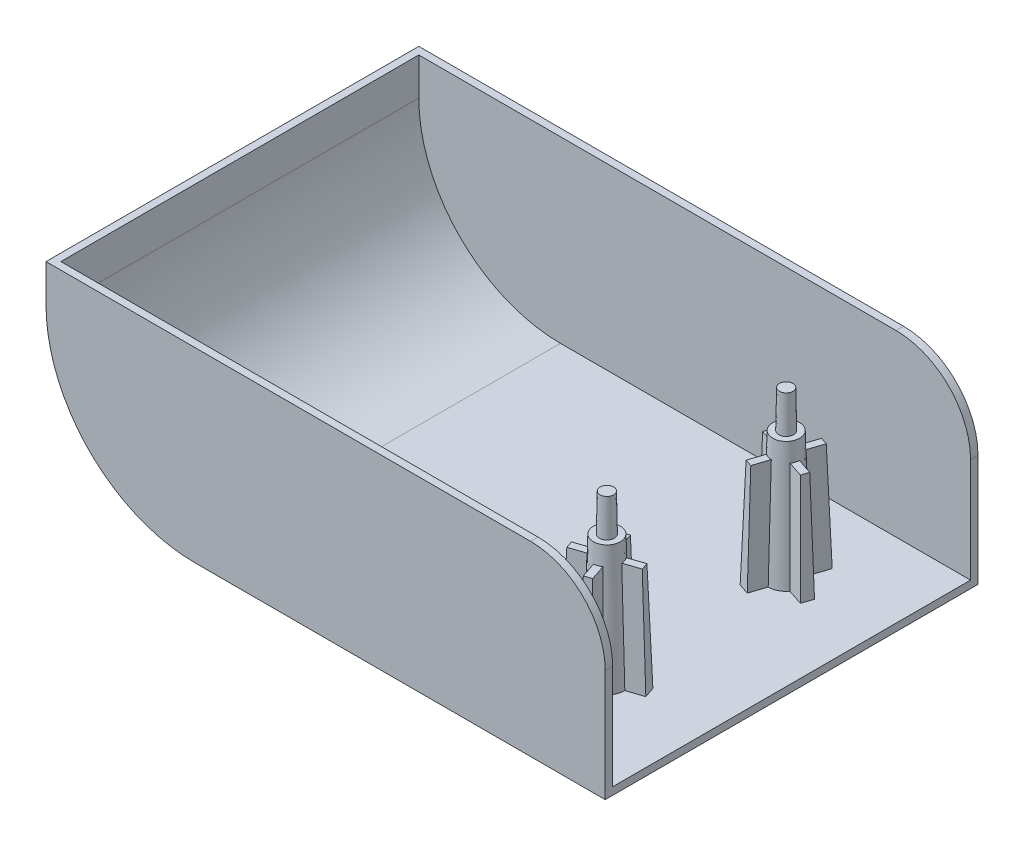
ISO-10303-21;
HEADER;
FILE_DESCRIPTION(('STEP AP214'),'2;1');
FILE_NAME('part.step','',(''),(''),'','','');
FILE_SCHEMA(('AUTOMOTIVE_DESIGN { 1 0 10303 214 1 1 1 1 }'));
ENDSEC;
DATA;
#1=APPLICATION_CONTEXT('core data for automotive mechanical design processes');
#2=APPLICATION_PROTOCOL_DEFINITION('international standard','automotive_design',2000,#1);
#3=PRODUCT_CONTEXT('',#1,'mechanical');
#4=PRODUCT('Part','Part','',(#3));
#5=PRODUCT_RELATED_PRODUCT_CATEGORY('part','',(#4));
#6=PRODUCT_DEFINITION_FORMATION('','',#4);
#7=PRODUCT_DEFINITION_CONTEXT('part definition',#1,'design');
#8=PRODUCT_DEFINITION('design','',#6,#7);
#9=PRODUCT_DEFINITION_SHAPE('','',#8);
#10=(LENGTH_UNIT() NAMED_UNIT(*) SI_UNIT(.MILLI.,.METRE.));
#11=(NAMED_UNIT(*) PLANE_ANGLE_UNIT() SI_UNIT($,.RADIAN.));
#12=(NAMED_UNIT(*) SI_UNIT($,.STERADIAN.) SOLID_ANGLE_UNIT());
#13=UNCERTAINTY_MEASURE_WITH_UNIT(LENGTH_MEASURE(1.E-05),#10,'distance_accuracy_value','');
#14=(GEOMETRIC_REPRESENTATION_CONTEXT(3) GLOBAL_UNCERTAINTY_ASSIGNED_CONTEXT((#13)) GLOBAL_UNIT_ASSIGNED_CONTEXT((#10,
#11,#12)) REPRESENTATION_CONTEXT('',''));
#15=CARTESIAN_POINT('',(0.,0.,0.));
#16=DIRECTION('',(0.,0.,1.));
#17=DIRECTION('',(1.,0.,0.));
#18=AXIS2_PLACEMENT_3D('',#15,#16,#17);
#19=CARTESIAN_POINT('',(0.,0.,25.));
#20=DIRECTION('',(-1.,0.,0.));
#21=DIRECTION('',(0.,0.,1.));
#22=AXIS2_PLACEMENT_3D('',#19,#20,#21);
#23=PLANE('',#22);
#24=DIRECTION('',(0.,1.,0.));
#25=VECTOR('',#24,1.);
#26=CARTESIAN_POINT('',(0.,20.,-24.));
#27=LINE('',#26,#25);
#28=CARTESIAN_POINT('',(0.,1.,-24.));
#29=VERTEX_POINT('',#28);
#30=CARTESIAN_POINT('',(0.,15.,-24.));
#31=VERTEX_POINT('',#30);
#32=EDGE_CURVE('E1315',#29,#31,#27,.T.);
#33=ORIENTED_EDGE('',*,*,#32,.F.);
#34=DIRECTION('',(0.,0.,-1.));
#35=VECTOR('',#34,1.);
#36=CARTESIAN_POINT('',(0.,1.,25.));
#37=LINE('',#36,#35);
#38=CARTESIAN_POINT('',(0.,1.,24.));
#39=VERTEX_POINT('',#38);
#40=EDGE_CURVE('E1310',#39,#29,#37,.T.);
#41=ORIENTED_EDGE('',*,*,#40,.F.);
#42=DIRECTION('',(0.,1.,0.));
#43=VECTOR('',#42,1.);
#44=CARTESIAN_POINT('',(0.,20.,24.));
#45=LINE('',#44,#43);
#46=CARTESIAN_POINT('',(0.,15.,24.));
#47=VERTEX_POINT('',#46);
#48=EDGE_CURVE('E1299',#39,#47,#45,.T.);
#49=ORIENTED_EDGE('',*,*,#48,.T.);
#50=DIRECTION('',(0.,0.,-1.));
#51=VECTOR('',#50,1.);
#52=CARTESIAN_POINT('',(0.,15.,25.));
#53=LINE('',#52,#51);
#54=CARTESIAN_POINT('',(0.,15.,25.));
#55=VERTEX_POINT('',#54);
#56=EDGE_CURVE('E584',#47,#55,#53,.F.);
#57=ORIENTED_EDGE('',*,*,#56,.T.);
#58=DIRECTION('',(0.,1.,0.));
#59=VECTOR('',#58,1.);
#60=CARTESIAN_POINT('',(0.,0.,25.));
#61=LINE('',#60,#59);
#62=CARTESIAN_POINT('',(0.,0.,25.));
#63=VERTEX_POINT('',#62);
#64=EDGE_CURVE('E549',#63,#55,#61,.T.);
#65=ORIENTED_EDGE('',*,*,#64,.F.);
#66=DIRECTION('',(0.,0.,-1.));
#67=VECTOR('',#66,1.);
#68=CARTESIAN_POINT('',(0.,0.,25.));
#69=LINE('',#68,#67);
#70=CARTESIAN_POINT('',(0.,0.,-25.));
#71=VERTEX_POINT('',#70);
#72=EDGE_CURVE('E534',#63,#71,#69,.T.);
#73=ORIENTED_EDGE('',*,*,#72,.T.);
#74=DIRECTION('',(0.,1.,0.));
#75=VECTOR('',#74,1.);
#76=CARTESIAN_POINT('',(0.,0.,-25.));
#77=LINE('',#76,#75);
#78=CARTESIAN_POINT('',(0.,15.,-25.));
#79=VERTEX_POINT('',#78);
#80=EDGE_CURVE('E542',#71,#79,#77,.T.);
#81=ORIENTED_EDGE('',*,*,#80,.T.);
#82=EDGE_CURVE('E585',#79,#31,#53,.F.);
#83=ORIENTED_EDGE('',*,*,#82,.T.);
#84=EDGE_LOOP('',(#33,#41,#49,#57,#65,#73,#81,#83));
#85=FACE_BOUND('',#84,.T.);
#86=ADVANCED_FACE('F32',(#85),#23,.F.);
#87=CARTESIAN_POINT('',(-10.,15.,25.));
#88=DIRECTION('',(0.,0.,-1.));
#89=DIRECTION('',(-1.,0.,0.));
#90=AXIS2_PLACEMENT_3D('',#87,#88,#89);
#91=CYLINDRICAL_SURFACE('',#90,10.);
#92=ORIENTED_EDGE('',*,*,#56,.F.);
#93=CARTESIAN_POINT('',(-10.,15.,24.));
#94=DIRECTION('',(0.,0.,-1.));
#95=DIRECTION('',(-1.,0.,0.));
#96=AXIS2_PLACEMENT_3D('',#93,#94,#95);
#97=CIRCLE('',#96,10.);
#98=CARTESIAN_POINT('',(-10.,25.,24.));
#99=VERTEX_POINT('',#98);
#100=EDGE_CURVE('E1294',#47,#99,#97,.F.);
#101=ORIENTED_EDGE('',*,*,#100,.T.);
#102=DIRECTION('',(0.,0.,-1.));
#103=VECTOR('',#102,1.);
#104=CARTESIAN_POINT('',(-10.,25.,25.));
#105=LINE('',#104,#103);
#106=CARTESIAN_POINT('',(-10.,25.,25.));
#107=VERTEX_POINT('',#106);
#108=EDGE_CURVE('E580',#107,#99,#105,.T.);
#109=ORIENTED_EDGE('',*,*,#108,.F.);
#110=CARTESIAN_POINT('',(-10.,15.,25.));
#111=DIRECTION('',(0.,0.,-1.));
#112=DIRECTION('',(-1.,0.,0.));
#113=AXIS2_PLACEMENT_3D('',#110,#111,#112);
#114=CIRCLE('',#113,10.);
#115=EDGE_CURVE('E587',#55,#107,#114,.F.);
#116=ORIENTED_EDGE('',*,*,#115,.F.);
#117=EDGE_LOOP('',(#92,#101,#109,#116));
#118=FACE_BOUND('',#117,.T.);
#119=ADVANCED_FACE('F507',(#118),#91,.T.);
#120=CARTESIAN_POINT('',(-10.,25.,-24.));
#121=VERTEX_POINT('',#120);
#122=CARTESIAN_POINT('',(-10.,25.,-25.));
#123=VERTEX_POINT('',#122);
#124=EDGE_CURVE('E579',#121,#123,#105,.T.);
#125=ORIENTED_EDGE('',*,*,#124,.F.);
#126=CARTESIAN_POINT('',(-10.,15.,-24.));
#127=DIRECTION('',(0.,0.,-1.));
#128=DIRECTION('',(-1.,0.,0.));
#129=AXIS2_PLACEMENT_3D('',#126,#127,#128);
#130=CIRCLE('',#129,10.);
#131=EDGE_CURVE('E1296',#121,#31,#130,.T.);
#132=ORIENTED_EDGE('',*,*,#131,.T.);
#133=ORIENTED_EDGE('',*,*,#82,.F.);
#134=CARTESIAN_POINT('',(-10.,15.,-25.));
#135=DIRECTION('',(0.,0.,-1.));
#136=DIRECTION('',(-1.,0.,0.));
#137=AXIS2_PLACEMENT_3D('',#134,#135,#136);
#138=CIRCLE('',#137,10.);
#139=EDGE_CURVE('E555',#123,#79,#138,.T.);
#140=ORIENTED_EDGE('',*,*,#139,.F.);
#141=EDGE_LOOP('',(#125,#132,#133,#140));
#142=FACE_BOUND('',#141,.T.);
#143=ADVANCED_FACE('F513',(#142),#91,.T.);
#144=CARTESIAN_POINT('',(-55.,20.,25.));
#145=DIRECTION('',(0.,0.,-1.));
#146=DIRECTION('',(-1.,0.,0.));
#147=AXIS2_PLACEMENT_3D('',#144,#145,#146);
#148=CYLINDRICAL_SURFACE('',#147,20.);
#149=CARTESIAN_POINT('',(-55.,20.,-25.));
#150=DIRECTION('',(0.,0.,1.));
#151=DIRECTION('',(-1.,0.,0.));
#152=AXIS2_PLACEMENT_3D('',#149,#150,#151);
#153=CIRCLE('',#152,20.);
#154=CARTESIAN_POINT('',(-75.,20.,-25.));
#155=VERTEX_POINT('',#154);
#156=CARTESIAN_POINT('',(-55.,0.,-25.));
#157=VERTEX_POINT('',#156);
#158=EDGE_CURVE('E543',#155,#157,#153,.T.);
#159=ORIENTED_EDGE('',*,*,#158,.T.);
#160=DIRECTION('',(0.,0.,-1.));
#161=VECTOR('',#160,1.);
#162=CARTESIAN_POINT('',(-55.,0.,25.));
#163=LINE('',#162,#161);
#164=CARTESIAN_POINT('',(-55.,0.,25.));
#165=VERTEX_POINT('',#164);
#166=EDGE_CURVE('E537',#165,#157,#163,.T.);
#167=ORIENTED_EDGE('',*,*,#166,.F.);
#168=CARTESIAN_POINT('',(-55.,20.,25.));
#169=DIRECTION('',(0.,0.,1.));
#170=DIRECTION('',(-1.,0.,0.));
#171=AXIS2_PLACEMENT_3D('',#168,#169,#170);
#172=CIRCLE('',#171,20.);
#173=CARTESIAN_POINT('',(-75.,20.,25.));
#174=VERTEX_POINT('',#173);
#175=EDGE_CURVE('E563',#174,#165,#172,.T.);
#176=ORIENTED_EDGE('',*,*,#175,.F.);
#177=DIRECTION('',(0.,0.,-1.));
#178=VECTOR('',#177,1.);
#179=CARTESIAN_POINT('',(-75.,20.,25.));
#180=LINE('',#179,#178);
#181=EDGE_CURVE('E573',#174,#155,#180,.T.);
#182=ORIENTED_EDGE('',*,*,#181,.T.);
#183=EDGE_LOOP('',(#159,#167,#176,#182));
#184=FACE_BOUND('',#183,.T.);
#185=ADVANCED_FACE('F34',(#184),#148,.T.);
#186=CARTESIAN_POINT('',(0.,0.,25.));
#187=DIRECTION('',(0.,1.,0.));
#188=DIRECTION('',(0.,0.,1.));
#189=AXIS2_PLACEMENT_3D('',#186,#187,#188);
#190=PLANE('',#189);
#191=DIRECTION('',(1.,0.,0.));
#192=VECTOR('',#191,1.);
#193=CARTESIAN_POINT('',(0.,0.,-25.));
#194=LINE('',#193,#192);
#195=EDGE_CURVE('E532',#157,#71,#194,.T.);
#196=ORIENTED_EDGE('',*,*,#195,.T.);
#197=ORIENTED_EDGE('',*,*,#72,.F.);
#198=DIRECTION('',(1.,0.,0.));
#199=VECTOR('',#198,1.);
#200=CARTESIAN_POINT('',(0.,0.,25.));
#201=LINE('',#200,#199);
#202=EDGE_CURVE('E566',#165,#63,#201,.T.);
#203=ORIENTED_EDGE('',*,*,#202,.F.);
#204=ORIENTED_EDGE('',*,*,#166,.T.);
#205=EDGE_LOOP('',(#196,#197,#203,#204));
#206=FACE_BOUND('',#205,.T.);
#207=ADVANCED_FACE('F520',(#206),#190,.F.);
#208=CARTESIAN_POINT('',(0.,25.,25.));
#209=DIRECTION('',(0.,-1.,0.));
#210=DIRECTION('',(0.,0.,-1.));
#211=AXIS2_PLACEMENT_3D('',#208,#209,#210);
#212=PLANE('',#211);
#213=ORIENTED_EDGE('',*,*,#108,.T.);
#214=DIRECTION('',(-1.,0.,0.));
#215=VECTOR('',#214,1.);
#216=CARTESIAN_POINT('',(-55.,25.,24.));
#217=LINE('',#216,#215);
#218=CARTESIAN_POINT('',(-74.,25.,24.));
#219=VERTEX_POINT('',#218);
#220=EDGE_CURVE('E1301',#99,#219,#217,.T.);
#221=ORIENTED_EDGE('',*,*,#220,.T.);
#222=DIRECTION('',(0.,0.,-1.));
#223=VECTOR('',#222,1.);
#224=CARTESIAN_POINT('',(-74.,25.,25.));
#225=LINE('',#224,#223);
#226=CARTESIAN_POINT('',(-74.,25.,-24.));
#227=VERTEX_POINT('',#226);
#228=EDGE_CURVE('E1307',#219,#227,#225,.T.);
#229=ORIENTED_EDGE('',*,*,#228,.T.);
#230=DIRECTION('',(-1.,0.,0.));
#231=VECTOR('',#230,1.);
#232=CARTESIAN_POINT('',(-55.,25.,-24.));
#233=LINE('',#232,#231);
#234=EDGE_CURVE('E1312',#121,#227,#233,.T.);
#235=ORIENTED_EDGE('',*,*,#234,.F.);
#236=ORIENTED_EDGE('',*,*,#124,.T.);
#237=DIRECTION('',(-1.,0.,0.));
#238=VECTOR('',#237,1.);
#239=CARTESIAN_POINT('',(0.,25.,-25.));
#240=LINE('',#239,#238);
#241=CARTESIAN_POINT('',(-75.,25.,-25.));
#242=VERTEX_POINT('',#241);
#243=EDGE_CURVE('E556',#123,#242,#240,.T.);
#244=ORIENTED_EDGE('',*,*,#243,.T.);
#245=DIRECTION('',(0.,0.,-1.));
#246=VECTOR('',#245,1.);
#247=CARTESIAN_POINT('',(-75.,25.,25.));
#248=LINE('',#247,#246);
#249=CARTESIAN_POINT('',(-75.,25.,25.));
#250=VERTEX_POINT('',#249);
#251=EDGE_CURVE('E550',#250,#242,#248,.T.);
#252=ORIENTED_EDGE('',*,*,#251,.F.);
#253=DIRECTION('',(-1.,0.,0.));
#254=VECTOR('',#253,1.);
#255=CARTESIAN_POINT('',(0.,25.,25.));
#256=LINE('',#255,#254);
#257=EDGE_CURVE('E569',#107,#250,#256,.T.);
#258=ORIENTED_EDGE('',*,*,#257,.F.);
#259=EDGE_LOOP('',(#213,#221,#229,#235,#236,#244,#252,#258));
#260=FACE_BOUND('',#259,.T.);
#261=ADVANCED_FACE('F518',(#260),#212,.F.);
#262=CARTESIAN_POINT('',(-75.,20.,25.));
#263=DIRECTION('',(1.,0.,0.));
#264=DIRECTION('',(0.,1.,0.));
#265=AXIS2_PLACEMENT_3D('',#262,#263,#264);
#266=PLANE('',#265);
#267=DIRECTION('',(0.,-1.,0.));
#268=VECTOR('',#267,1.);
#269=CARTESIAN_POINT('',(-75.,20.,-25.));
#270=LINE('',#269,#268);
#271=EDGE_CURVE('E558',#242,#155,#270,.T.);
#272=ORIENTED_EDGE('',*,*,#271,.T.);
#273=ORIENTED_EDGE('',*,*,#181,.F.);
#274=DIRECTION('',(0.,-1.,0.));
#275=VECTOR('',#274,1.);
#276=CARTESIAN_POINT('',(-75.,20.,25.));
#277=LINE('',#276,#275);
#278=EDGE_CURVE('E571',#250,#174,#277,.T.);
#279=ORIENTED_EDGE('',*,*,#278,.F.);
#280=ORIENTED_EDGE('',*,*,#251,.T.);
#281=EDGE_LOOP('',(#272,#273,#279,#280));
#282=FACE_BOUND('',#281,.T.);
#283=ADVANCED_FACE('F527',(#282),#266,.F.);
#284=CARTESIAN_POINT('',(-55.,20.,25.));
#285=DIRECTION('',(0.,0.,-1.));
#286=DIRECTION('',(-1.,0.,0.));
#287=AXIS2_PLACEMENT_3D('',#284,#285,#286);
#288=PLANE('',#287);
#289=ORIENTED_EDGE('',*,*,#64,.T.);
#290=ORIENTED_EDGE('',*,*,#115,.T.);
#291=ORIENTED_EDGE('',*,*,#257,.T.);
#292=ORIENTED_EDGE('',*,*,#278,.T.);
#293=ORIENTED_EDGE('',*,*,#175,.T.);
#294=ORIENTED_EDGE('',*,*,#202,.T.);
#295=EDGE_LOOP('',(#289,#290,#291,#292,#293,#294));
#296=FACE_BOUND('',#295,.T.);
#297=ADVANCED_FACE('F1261',(#296),#288,.F.);
#298=CARTESIAN_POINT('',(-55.,20.,-25.));
#299=DIRECTION('',(0.,0.,-1.));
#300=DIRECTION('',(-1.,0.,0.));
#301=AXIS2_PLACEMENT_3D('',#298,#299,#300);
#302=PLANE('',#301);
#303=ORIENTED_EDGE('',*,*,#243,.F.);
#304=ORIENTED_EDGE('',*,*,#139,.T.);
#305=ORIENTED_EDGE('',*,*,#80,.F.);
#306=ORIENTED_EDGE('',*,*,#195,.F.);
#307=ORIENTED_EDGE('',*,*,#158,.F.);
#308=ORIENTED_EDGE('',*,*,#271,.F.);
#309=EDGE_LOOP('',(#303,#304,#305,#306,#307,#308));
#310=FACE_BOUND('',#309,.T.);
#311=ADVANCED_FACE('F553',(#310),#302,.T.);
#312=CARTESIAN_POINT('',(-55.,20.,25.));
#313=DIRECTION('',(0.,0.,-1.));
#314=DIRECTION('',(-1.,0.,0.));
#315=AXIS2_PLACEMENT_3D('',#312,#313,#314);
#316=CYLINDRICAL_SURFACE('',#315,19.);
#317=CARTESIAN_POINT('',(-55.,20.,-24.));
#318=DIRECTION('',(0.,0.,-1.));
#319=DIRECTION('',(-1.,0.,0.));
#320=AXIS2_PLACEMENT_3D('',#317,#318,#319);
#321=CIRCLE('',#320,19.);
#322=CARTESIAN_POINT('',(-74.,20.,-24.));
#323=VERTEX_POINT('',#322);
#324=CARTESIAN_POINT('',(-55.,1.,-24.));
#325=VERTEX_POINT('',#324);
#326=EDGE_CURVE('E1328',#323,#325,#321,.F.);
#327=ORIENTED_EDGE('',*,*,#326,.F.);
#328=DIRECTION('',(0.,0.,-1.));
#329=VECTOR('',#328,1.);
#330=CARTESIAN_POINT('',(-74.,20.,25.));
#331=LINE('',#330,#329);
#332=CARTESIAN_POINT('',(-74.,20.,24.));
#333=VERTEX_POINT('',#332);
#334=EDGE_CURVE('E1311',#333,#323,#331,.T.);
#335=ORIENTED_EDGE('',*,*,#334,.F.);
#336=CARTESIAN_POINT('',(-55.,20.,24.));
#337=DIRECTION('',(0.,0.,-1.));
#338=DIRECTION('',(-1.,0.,0.));
#339=AXIS2_PLACEMENT_3D('',#336,#337,#338);
#340=CIRCLE('',#339,19.);
#341=CARTESIAN_POINT('',(-55.,1.,24.));
#342=VERTEX_POINT('',#341);
#343=EDGE_CURVE('E1324',#333,#342,#340,.F.);
#344=ORIENTED_EDGE('',*,*,#343,.T.);
#345=DIRECTION('',(0.,0.,1.));
#346=VECTOR('',#345,1.);
#347=CARTESIAN_POINT('',(-55.,1.,25.));
#348=LINE('',#347,#346);
#349=EDGE_CURVE('E1318',#342,#325,#348,.F.);
#350=ORIENTED_EDGE('',*,*,#349,.T.);
#351=EDGE_LOOP('',(#327,#335,#344,#350));
#352=FACE_BOUND('',#351,.T.);
#353=ADVANCED_FACE('F1019',(#352),#316,.F.);
#354=CARTESIAN_POINT('',(0.,1.,25.));
#355=DIRECTION('',(0.,1.,0.));
#356=DIRECTION('',(0.,0.,1.));
#357=AXIS2_PLACEMENT_3D('',#354,#355,#356);
#358=PLANE('',#357);
#359=DIRECTION('',(-0.316227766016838,0.,0.948683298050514));
#360=VECTOR('',#359,1.);
#361=CARTESIAN_POINT('',(-14.2335000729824,1.,6.67099187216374));
#362=LINE('',#361,#360);
#363=CARTESIAN_POINT('',(-8.23938223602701,1.,-11.3113616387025));
#364=VERTEX_POINT('',#363);
#365=CARTESIAN_POINT('',(-8.71372388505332,1.,-9.88833669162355));
#366=VERTEX_POINT('',#365);
#367=EDGE_CURVE('E51',#364,#366,#362,.T.);
#368=ORIENTED_EDGE('',*,*,#367,.T.);
#369=DIRECTION('',(-0.948683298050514,0.,-0.316227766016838));
#370=VECTOR('',#369,1.);
#371=CARTESIAN_POINT('',(-11.0914573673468,1.,-10.6809145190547));
#372=LINE('',#371,#370);
#373=CARTESIAN_POINT('',(-10.8260132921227,1.,-10.5924331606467));
#374=VERTEX_POINT('',#373);
#375=EDGE_CURVE('E763',#366,#374,#372,.T.);
#376=ORIENTED_EDGE('',*,*,#375,.T.);
#377=CARTESIAN_POINT('',(-12.7516531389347,1.,-12.0248825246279));
#378=DIRECTION('',(0.,1.,0.));
#379=DIRECTION('',(0.,0.,1.));
#380=AXIS2_PLACEMENT_3D('',#377,#378,#379);
#381=CIRCLE('',#380,2.4);
#382=CARTESIAN_POINT('',(-12.7610775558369,1.,-9.6249010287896));
#383=VERTEX_POINT('',#382);
#384=EDGE_CURVE('E753',#374,#383,#381,.F.);
#385=ORIENTED_EDGE('',*,*,#384,.T.);
#386=DIRECTION('',(-0.316227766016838,0.,0.948683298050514));
#387=VECTOR('',#386,1.);
#388=CARTESIAN_POINT('',(-12.6725961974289,1.,-9.89034510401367));
#389=LINE('',#388,#387);
#390=CARTESIAN_POINT('',(-13.46517402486,1.,-7.5126116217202));
#391=VERTEX_POINT('',#390);
#392=EDGE_CURVE('E757',#383,#391,#389,.T.);
#393=ORIENTED_EDGE('',*,*,#392,.T.);
#394=DIRECTION('',(-0.948683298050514,0.,-0.316227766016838));
#395=VECTOR('',#394,1.);
#396=CARTESIAN_POINT('',(-31.4475275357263,1.,-13.5067294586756));
#397=LINE('',#396,#395);
#398=CARTESIAN_POINT('',(-14.888198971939,1.,-7.98695327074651));
#399=VERTEX_POINT('',#398);
#400=EDGE_CURVE('E758',#391,#399,#397,.T.);
#401=ORIENTED_EDGE('',*,*,#400,.T.);
#402=DIRECTION('',(0.316227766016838,0.,-0.948683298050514));
#403=VECTOR('',#402,1.);
#404=CARTESIAN_POINT('',(-14.0956211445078,1.,-10.36468675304));
#405=LINE('',#404,#403);
#406=CARTESIAN_POINT('',(-14.1841025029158,1.,-10.0992426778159));
#407=VERTEX_POINT('',#406);
#408=EDGE_CURVE('E756',#399,#407,#405,.T.);
#409=ORIENTED_EDGE('',*,*,#408,.T.);
#410=CARTESIAN_POINT('',(-15.1516346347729,1.,-12.0343069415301));
#411=VERTEX_POINT('',#410);
#412=EDGE_CURVE('E730',#407,#411,#381,.F.);
#413=ORIENTED_EDGE('',*,*,#412,.T.);
#414=DIRECTION('',(-0.948683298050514,0.,-0.316227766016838));
#415=VECTOR('',#414,1.);
#416=CARTESIAN_POINT('',(-14.8861905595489,1.,-11.9458255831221));
#417=LINE('',#416,#415);
#418=CARTESIAN_POINT('',(-17.2639240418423,0.999999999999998,-12.7384034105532));
#419=VERTEX_POINT('',#418);
#420=EDGE_CURVE('E736',#411,#419,#417,.T.);
#421=ORIENTED_EDGE('',*,*,#420,.T.);
#422=DIRECTION('',(0.316227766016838,0.,-0.948683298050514));
#423=VECTOR('',#422,1.);
#424=CARTESIAN_POINT('',(-11.2698062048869,1.,-30.7207569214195));
#425=LINE('',#424,#423);
#426=CARTESIAN_POINT('',(-16.789582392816,1.,-14.1614283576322));
#427=VERTEX_POINT('',#426);
#428=EDGE_CURVE('E328',#419,#427,#425,.T.);
#429=ORIENTED_EDGE('',*,*,#428,.T.);
#430=DIRECTION('',(0.948683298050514,0.,0.316227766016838));
#431=VECTOR('',#430,1.);
#432=CARTESIAN_POINT('',(-14.4118489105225,1.,-13.368850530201));
#433=LINE('',#432,#431);
#434=CARTESIAN_POINT('',(-14.6772929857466,1.,-13.457331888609));
#435=VERTEX_POINT('',#434);
#436=EDGE_CURVE('E734',#427,#435,#433,.T.);
#437=ORIENTED_EDGE('',*,*,#436,.T.);
#438=CARTESIAN_POINT('',(-12.7422287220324,1.,-14.4248640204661));
#439=VERTEX_POINT('',#438);
#440=EDGE_CURVE('E742',#435,#439,#381,.F.);
#441=ORIENTED_EDGE('',*,*,#440,.T.);
#442=DIRECTION('',(0.316227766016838,0.,-0.948683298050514));
#443=VECTOR('',#442,1.);
#444=CARTESIAN_POINT('',(-12.8307100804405,1.,-14.159419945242));
#445=LINE('',#444,#443);
#446=CARTESIAN_POINT('',(-12.0381322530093,1.,-16.5371534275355));
#447=VERTEX_POINT('',#446);
#448=EDGE_CURVE('E754',#439,#447,#445,.T.);
#449=ORIENTED_EDGE('',*,*,#448,.T.);
#450=DIRECTION('',(0.948683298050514,0.,0.316227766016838));
#451=VECTOR('',#450,1.);
#452=CARTESIAN_POINT('',(5.94422125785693,1.,-10.5430355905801));
#453=LINE('',#452,#451);
#454=CARTESIAN_POINT('',(-10.6151073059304,1.,-16.0628117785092));
#455=VERTEX_POINT('',#454);
#456=EDGE_CURVE('E746',#447,#455,#453,.T.);
#457=ORIENTED_EDGE('',*,*,#456,.T.);
#458=DIRECTION('',(-0.316227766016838,0.,0.948683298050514));
#459=VECTOR('',#458,1.);
#460=CARTESIAN_POINT('',(-11.4076851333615,1.,-13.6850782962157));
#461=LINE('',#460,#459);
#462=CARTESIAN_POINT('',(-11.3192037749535,1.,-13.9505223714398));
#463=VERTEX_POINT('',#462);
#464=EDGE_CURVE('E748',#455,#463,#461,.T.);
#465=ORIENTED_EDGE('',*,*,#464,.T.);
#466=CARTESIAN_POINT('',(-10.3516716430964,1.,-12.0154581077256));
#467=VERTEX_POINT('',#466);
#468=EDGE_CURVE('E772',#463,#467,#381,.F.);
#469=ORIENTED_EDGE('',*,*,#468,.T.);
#470=DIRECTION('',(0.948683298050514,0.,0.316227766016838));
#471=VECTOR('',#470,1.);
#472=CARTESIAN_POINT('',(-10.6171157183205,1.,-12.1039394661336));
#473=LINE('',#472,#471);
#474=EDGE_CURVE('E47',#467,#364,#473,.T.);
#475=ORIENTED_EDGE('',*,*,#474,.T.);
#476=EDGE_LOOP('',(#368,#376,#385,#393,#401,#409,#413,#421,#429,#437,#441,#449,#457,#465,#469,#475));
#477=FACE_BOUND('',#476,.T.);
#478=DIRECTION('',(0.316227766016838,0.,0.948683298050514));
#479=VECTOR('',#478,1.);
#480=CARTESIAN_POINT('',(-14.2335000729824,1.,-6.67099187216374));
#481=LINE('',#480,#479);
#482=CARTESIAN_POINT('',(-8.71372388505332,1.,9.88833669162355));
#483=VERTEX_POINT('',#482);
#484=CARTESIAN_POINT('',(-8.23938223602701,1.,11.3113616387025));
#485=VERTEX_POINT('',#484);
#486=EDGE_CURVE('E704',#483,#485,#481,.T.);
#487=ORIENTED_EDGE('',*,*,#486,.T.);
#488=DIRECTION('',(-0.948683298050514,0.,0.316227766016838));
#489=VECTOR('',#488,1.);
#490=CARTESIAN_POINT('',(-10.6171157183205,1.,12.1039394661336));
#491=LINE('',#490,#489);
#492=CARTESIAN_POINT('',(-10.3516716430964,1.,12.0154581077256));
#493=VERTEX_POINT('',#492);
#494=EDGE_CURVE('E653',#485,#493,#491,.T.);
#495=ORIENTED_EDGE('',*,*,#494,.T.);
#496=CARTESIAN_POINT('',(-12.7516531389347,1.,12.0248825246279));
#497=DIRECTION('',(0.,1.,0.));
#498=DIRECTION('',(0.,0.,1.));
#499=AXIS2_PLACEMENT_3D('',#496,#497,#498);
#500=CIRCLE('',#499,2.4);
#501=CARTESIAN_POINT('',(-11.3192037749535,1.,13.9505223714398));
#502=VERTEX_POINT('',#501);
#503=EDGE_CURVE('E1395',#493,#502,#500,.F.);
#504=ORIENTED_EDGE('',*,*,#503,.T.);
#505=DIRECTION('',(0.316227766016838,0.,0.948683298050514));
#506=VECTOR('',#505,1.);
#507=CARTESIAN_POINT('',(-11.4076851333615,1.,13.6850782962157));
#508=LINE('',#507,#506);
#509=CARTESIAN_POINT('',(-10.6151073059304,1.,16.0628117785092));
#510=VERTEX_POINT('',#509);
#511=EDGE_CURVE('E713',#502,#510,#508,.T.);
#512=ORIENTED_EDGE('',*,*,#511,.T.);
#513=DIRECTION('',(-0.948683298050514,0.,0.316227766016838));
#514=VECTOR('',#513,1.);
#515=CARTESIAN_POINT('',(5.94422125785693,1.,10.5430355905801));
#516=LINE('',#515,#514);
#517=CARTESIAN_POINT('',(-12.0381322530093,1.,16.5371534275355));
#518=VERTEX_POINT('',#517);
#519=EDGE_CURVE('E715',#510,#518,#516,.T.);
#520=ORIENTED_EDGE('',*,*,#519,.T.);
#521=DIRECTION('',(-0.316227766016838,0.,-0.948683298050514));
#522=VECTOR('',#521,1.);
#523=CARTESIAN_POINT('',(-12.8307100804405,1.,14.159419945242));
#524=LINE('',#523,#522);
#525=CARTESIAN_POINT('',(-12.7422287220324,1.,14.4248640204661));
#526=VERTEX_POINT('',#525);
#527=EDGE_CURVE('E707',#518,#526,#524,.T.);
#528=ORIENTED_EDGE('',*,*,#527,.T.);
#529=CARTESIAN_POINT('',(-14.6772929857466,1.,13.457331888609));
#530=VERTEX_POINT('',#529);
#531=EDGE_CURVE('E711',#526,#530,#500,.F.);
#532=ORIENTED_EDGE('',*,*,#531,.T.);
#533=DIRECTION('',(-0.948683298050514,0.,0.316227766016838));
#534=VECTOR('',#533,1.);
#535=CARTESIAN_POINT('',(-14.4118489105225,1.,13.368850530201));
#536=LINE('',#535,#534);
#537=CARTESIAN_POINT('',(-16.789582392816,0.999999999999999,14.1614283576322));
#538=VERTEX_POINT('',#537);
#539=EDGE_CURVE('E725',#530,#538,#536,.T.);
#540=ORIENTED_EDGE('',*,*,#539,.T.);
#541=DIRECTION('',(-0.316227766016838,0.,-0.948683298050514));
#542=VECTOR('',#541,1.);
#543=CARTESIAN_POINT('',(-11.2698062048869,1.,30.7207569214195));
#544=LINE('',#543,#542);
#545=CARTESIAN_POINT('',(-17.2639240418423,1.,12.7384034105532));
#546=VERTEX_POINT('',#545);
#547=EDGE_CURVE('E722',#538,#546,#544,.T.);
#548=ORIENTED_EDGE('',*,*,#547,.T.);
#549=DIRECTION('',(0.948683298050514,0.,-0.316227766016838));
#550=VECTOR('',#549,1.);
#551=CARTESIAN_POINT('',(-14.8861905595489,1.,11.9458255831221));
#552=LINE('',#551,#550);
#553=CARTESIAN_POINT('',(-15.1516346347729,1.,12.0343069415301));
#554=VERTEX_POINT('',#553);
#555=EDGE_CURVE('E717',#546,#554,#552,.T.);
#556=ORIENTED_EDGE('',*,*,#555,.T.);
#557=CARTESIAN_POINT('',(-14.1841025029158,1.,10.0992426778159));
#558=VERTEX_POINT('',#557);
#559=EDGE_CURVE('E720',#554,#558,#500,.F.);
#560=ORIENTED_EDGE('',*,*,#559,.T.);
#561=DIRECTION('',(-0.316227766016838,0.,-0.948683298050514));
#562=VECTOR('',#561,1.);
#563=CARTESIAN_POINT('',(-14.0956211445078,1.,10.36468675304));
#564=LINE('',#563,#562);
#565=CARTESIAN_POINT('',(-14.888198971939,1.,7.9869532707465));
#566=VERTEX_POINT('',#565);
#567=EDGE_CURVE('E652',#558,#566,#564,.T.);
#568=ORIENTED_EDGE('',*,*,#567,.T.);
#569=DIRECTION('',(0.948683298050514,0.,-0.316227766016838));
#570=VECTOR('',#569,1.);
#571=CARTESIAN_POINT('',(-31.4475275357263,1.,13.5067294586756));
#572=LINE('',#571,#570);
#573=CARTESIAN_POINT('',(-13.46517402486,1.,7.5126116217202));
#574=VERTEX_POINT('',#573);
#575=EDGE_CURVE('E644',#566,#574,#572,.T.);
#576=ORIENTED_EDGE('',*,*,#575,.T.);
#577=DIRECTION('',(0.316227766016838,0.,0.948683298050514));
#578=VECTOR('',#577,1.);
#579=CARTESIAN_POINT('',(-12.6725961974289,1.,9.89034510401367));
#580=LINE('',#579,#578);
#581=CARTESIAN_POINT('',(-12.7610775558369,1.,9.6249010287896));
#582=VERTEX_POINT('',#581);
#583=EDGE_CURVE('E710',#574,#582,#580,.T.);
#584=ORIENTED_EDGE('',*,*,#583,.T.);
#585=CARTESIAN_POINT('',(-10.8260132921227,1.,10.5924331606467));
#586=VERTEX_POINT('',#585);
#587=EDGE_CURVE('E723',#582,#586,#500,.F.);
#588=ORIENTED_EDGE('',*,*,#587,.T.);
#589=DIRECTION('',(0.948683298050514,0.,-0.316227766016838));
#590=VECTOR('',#589,1.);
#591=CARTESIAN_POINT('',(-11.0914573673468,1.,10.6809145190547));
#592=LINE('',#591,#590);
#593=EDGE_CURVE('E706',#586,#483,#592,.T.);
#594=ORIENTED_EDGE('',*,*,#593,.T.);
#595=EDGE_LOOP('',(#487,#495,#504,#512,#520,#528,#532,#540,#548,#556,#560,#568,#576,#584,#588,#594));
#596=FACE_BOUND('',#595,.T.);
#597=DIRECTION('',(1.,0.,0.));
#598=VECTOR('',#597,1.);
#599=CARTESIAN_POINT('',(-55.,1.,-24.));
#600=LINE('',#599,#598);
#601=EDGE_CURVE('E1320',#325,#29,#600,.T.);
#602=ORIENTED_EDGE('',*,*,#601,.F.);
#603=ORIENTED_EDGE('',*,*,#349,.F.);
#604=DIRECTION('',(1.,0.,0.));
#605=VECTOR('',#604,1.);
#606=CARTESIAN_POINT('',(-55.,1.,24.));
#607=LINE('',#606,#605);
#608=EDGE_CURVE('E1302',#342,#39,#607,.T.);
#609=ORIENTED_EDGE('',*,*,#608,.T.);
#610=ORIENTED_EDGE('',*,*,#40,.T.);
#611=EDGE_LOOP('',(#602,#603,#609,#610));
#612=FACE_BOUND('',#611,.T.);
#613=ADVANCED_FACE('F744',(#477,#596,#612),#358,.T.);
#614=CARTESIAN_POINT('',(-74.,20.,25.));
#615=DIRECTION('',(1.,0.,0.));
#616=DIRECTION('',(0.,1.,0.));
#617=AXIS2_PLACEMENT_3D('',#614,#615,#616);
#618=PLANE('',#617);
#619=DIRECTION('',(0.,-1.,0.));
#620=VECTOR('',#619,1.);
#621=CARTESIAN_POINT('',(-74.,19.9999999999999,-24.));
#622=LINE('',#621,#620);
#623=EDGE_CURVE('E1314',#227,#323,#622,.T.);
#624=ORIENTED_EDGE('',*,*,#623,.F.);
#625=ORIENTED_EDGE('',*,*,#228,.F.);
#626=DIRECTION('',(0.,-1.,0.));
#627=VECTOR('',#626,1.);
#628=CARTESIAN_POINT('',(-74.,19.9999999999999,24.));
#629=LINE('',#628,#627);
#630=EDGE_CURVE('E1306',#219,#333,#629,.T.);
#631=ORIENTED_EDGE('',*,*,#630,.T.);
#632=ORIENTED_EDGE('',*,*,#334,.T.);
#633=EDGE_LOOP('',(#624,#625,#631,#632));
#634=FACE_BOUND('',#633,.T.);
#635=ADVANCED_FACE('F1018',(#634),#618,.T.);
#636=CARTESIAN_POINT('',(-55.,20.,24.));
#637=DIRECTION('',(0.,0.,-1.));
#638=DIRECTION('',(-1.,0.,0.));
#639=AXIS2_PLACEMENT_3D('',#636,#637,#638);
#640=PLANE('',#639);
#641=ORIENTED_EDGE('',*,*,#48,.F.);
#642=ORIENTED_EDGE('',*,*,#608,.F.);
#643=ORIENTED_EDGE('',*,*,#343,.F.);
#644=ORIENTED_EDGE('',*,*,#630,.F.);
#645=ORIENTED_EDGE('',*,*,#220,.F.);
#646=ORIENTED_EDGE('',*,*,#100,.F.);
#647=EDGE_LOOP('',(#641,#642,#643,#644,#645,#646));
#648=FACE_BOUND('',#647,.T.);
#649=ADVANCED_FACE('F1202',(#648),#640,.T.);
#650=CARTESIAN_POINT('',(-55.,20.,-24.));
#651=DIRECTION('',(0.,0.,-1.));
#652=DIRECTION('',(-1.,0.,0.));
#653=AXIS2_PLACEMENT_3D('',#650,#651,#652);
#654=PLANE('',#653);
#655=ORIENTED_EDGE('',*,*,#234,.T.);
#656=ORIENTED_EDGE('',*,*,#623,.T.);
#657=ORIENTED_EDGE('',*,*,#326,.T.);
#658=ORIENTED_EDGE('',*,*,#601,.T.);
#659=ORIENTED_EDGE('',*,*,#32,.T.);
#660=ORIENTED_EDGE('',*,*,#131,.F.);
#661=EDGE_LOOP('',(#655,#656,#657,#658,#659,#660));
#662=FACE_BOUND('',#661,.T.);
#663=ADVANCED_FACE('F598',(#662),#654,.F.);
#664=CARTESIAN_POINT('',(-12.7516531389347,17.9999999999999,12.0248825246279));
#665=DIRECTION('',(0.,1.,0.));
#666=DIRECTION('',(0.948683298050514,0.,-0.316227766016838));
#667=AXIS2_PLACEMENT_3D('',#664,#665,#666);
#668=PLANE('',#667);
#669=CARTESIAN_POINT('',(-12.7516531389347,17.9999999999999,12.0248825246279));
#670=DIRECTION('',(0.,1.,0.));
#671=DIRECTION('',(0.,0.,1.));
#672=AXIS2_PLACEMENT_3D('',#669,#670,#671);
#673=CIRCLE('',#672,1.);
#674=CARTESIAN_POINT('',(-12.7516531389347,17.9999999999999,13.0248825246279));
#675=VERTEX_POINT('',#674);
#676=EDGE_CURVE('E40',#675,#675,#673,.T.);
#677=ORIENTED_EDGE('',*,*,#676,.F.);
#678=EDGE_LOOP('',(#677));
#679=FACE_BOUND('',#678,.T.);
#680=CARTESIAN_POINT('',(-12.7516531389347,17.9999999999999,12.0248825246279));
#681=DIRECTION('',(0.,-1.,0.));
#682=DIRECTION('',(-0.948683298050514,0.,0.316227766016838));
#683=AXIS2_PLACEMENT_3D('',#680,#681,#682);
#684=CIRCLE('',#683,1.80634691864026);
#685=CARTESIAN_POINT('',(-14.4653042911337,17.9999999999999,12.5960995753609));
#686=VERTEX_POINT('',#685);
#687=EDGE_CURVE('E602',#686,#686,#684,.T.);
#688=ORIENTED_EDGE('',*,*,#687,.F.);
#689=EDGE_LOOP('',(#688));
#690=FACE_BOUND('',#689,.T.);
#691=ADVANCED_FACE('F594',(#679,#690),#668,.T.);
#692=CARTESIAN_POINT('',(-12.7516531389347,17.9999999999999,12.0248825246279));
#693=DIRECTION('',(0.,-1.,0.));
#694=DIRECTION('',(-0.948683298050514,0.,0.316227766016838));
#695=AXIS2_PLACEMENT_3D('',#692,#693,#694);
#696=CONICAL_SURFACE('',#695,1.80634691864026,0.0349065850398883);
#697=ORIENTED_EDGE('',*,*,#559,.F.);
#698=CARTESIAN_POINT('',(-14.6423012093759,15.5002,12.1313219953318));
#699=CARTESIAN_POINT('',(-14.6853883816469,14.2811323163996,12.1232544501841));
#700=CARTESIAN_POINT('',(-14.7283975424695,13.0620620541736,12.1151608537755));
#701=CARTESIAN_POINT('',(-14.9430953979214,6.96669917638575,12.0745766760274));
#702=CARTESIAN_POINT('',(-15.1137402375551,2.09037211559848,12.0417375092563));
#703=CARTESIAN_POINT('',(-15.453880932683,-7.6623194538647,11.9756754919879));
#704=CARTESIAN_POINT('',(-15.6233767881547,-12.5386839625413,11.9424526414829));
#705=CARTESIAN_POINT('',(-15.9616596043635,-22.2914359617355,11.8757702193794));
#706=CARTESIAN_POINT('',(-16.1304465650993,-27.167823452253,11.8423106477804));
#707=CARTESIAN_POINT('',(-16.4675655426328,-36.9206132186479,11.7752395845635));
#708=CARTESIAN_POINT('',(-16.6358975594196,-41.7970154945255,11.7416280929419));
#709=CARTESIAN_POINT('',(-16.9722471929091,-51.5498301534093,11.6743001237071));
#710=CARTESIAN_POINT('',(-17.1402648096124,-56.4262425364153,11.6405836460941));
#711=CARTESIAN_POINT('',(-17.6439874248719,-71.0554898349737,11.5393239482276));
#712=CARTESIAN_POINT('',(-17.9793622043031,-80.8083353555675,11.4716704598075));
#713=CARTESIAN_POINT('',(-18.6496201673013,-100.314042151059,11.336199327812));
#714=CARTESIAN_POINT('',(-18.9845033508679,-110.066903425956,11.2683816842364));
#715=CARTESIAN_POINT('',(-19.9887041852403,-139.325501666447,11.0647789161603));
#716=CARTESIAN_POINT('',(-20.6575731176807,-158.831252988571,10.9288439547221));
#717=CARTESIAN_POINT('',(-21.9947769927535,-197.842772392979,10.6567957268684));
#718=CARTESIAN_POINT('',(-22.6631119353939,-217.348540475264,10.5206824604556));
#719=CARTESIAN_POINT('',(-23.9994792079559,-256.360086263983,10.2483548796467));
#720=CARTESIAN_POINT('',(-24.6675115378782,-275.865863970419,10.1121405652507));
#721=CARTESIAN_POINT('',(-26.3393960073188,-324.689482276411,9.7711172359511));
#722=CARTESIAN_POINT('',(-27.3431361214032,-354.007326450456,9.56627081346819));
#723=CARTESIAN_POINT('',(-29.3504027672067,-412.643021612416,9.15650664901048));
#724=CARTESIAN_POINT('',(-30.3539292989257,-441.96087260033,8.95158890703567));
#725=CARTESIAN_POINT('',(-33.3643217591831,-529.914431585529,8.3367731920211));
#726=CARTESIAN_POINT('',(-35.371000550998,-588.550145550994,7.92681273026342));
#727=CARTESIAN_POINT('',(-39.3841500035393,-705.821580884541,7.10682229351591));
#728=CARTESIAN_POINT('',(-41.390620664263,-764.457302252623,6.69679231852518));
#729=CARTESIAN_POINT('',(-45.4034382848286,-881.72874887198,5.87669106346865));
#730=CARTESIAN_POINT('',(-47.4097852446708,-940.364474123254,5.46661978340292));
#731=CARTESIAN_POINT('',(-49.4161125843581,-999.0002,5.05654195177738));
#732=B_SPLINE_CURVE_WITH_KNOTS('',3,(#698,#699,#700,#701,#702,#703,#704,#705,#706,#707,#708,
#709,#710,#711,#712,#713,#714,#715,#716,#717,#718,#719,#720,#721,#722,#723,#724,#725,#726,#727,
#728,#729,#730,#731),.UNSPECIFIED.,.F.,.F.,(4,2,2,2,2,2,2,2,2,2,2,2,2,2,2,2,4),(0.,
3.65956668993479,18.2978337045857,32.9361010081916,47.5743683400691,62.2126360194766,
76.8509036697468,106.127437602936,135.403971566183,193.957039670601,252.510106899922,
311.063174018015,399.07038388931,487.077593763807,663.092013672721,839.106435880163,
1015.12085790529),.UNSPECIFIED.);
#733=CARTESIAN_POINT('',(-14.6423082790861,15.5,12.1313206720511));
#734=VERTEX_POINT('',#733);
#735=EDGE_CURVE('E727',#734,#554,#732,.T.);
#736=ORIENTED_EDGE('',*,*,#735,.F.);
#737=CARTESIAN_POINT('',(-12.7516531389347,15.5,12.0248825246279));
#738=DIRECTION('',(0.,1.,0.));
#739=DIRECTION('',(0.948683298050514,0.,-0.316227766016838));
#740=AXIS2_PLACEMENT_3D('',#737,#738,#739);
#741=CIRCLE('',#740,1.89364884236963);
#742=CARTESIAN_POINT('',(-14.3280401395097,15.5,13.0741250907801));
#743=VERTEX_POINT('',#742);
#744=EDGE_CURVE('E1343',#743,#734,#741,.F.);
#745=ORIENTED_EDGE('',*,*,#744,.F.);
#746=CARTESIAN_POINT('',(-37.9022163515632,-999.0002,39.5982306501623));
#747=CARTESIAN_POINT('',(-37.623779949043,-986.98678309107,39.284380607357));
#748=CARTESIAN_POINT('',(-37.3453420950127,-974.973366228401,38.9705300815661));
#749=CARTESIAN_POINT('',(-36.7884631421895,-950.946532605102,38.3428279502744));
#750=CARTESIAN_POINT('',(-36.5100220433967,-938.933115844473,38.0289763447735));
#751=CARTESIAN_POINT('',(-35.674693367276,-902.892865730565,37.0874197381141));
#752=CARTESIAN_POINT('',(-35.1178004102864,-878.86603254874,36.4597129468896));
#753=CARTESIAN_POINT('',(-34.003996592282,-830.812366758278,35.2042934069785));
#754=CARTESIAN_POINT('',(-33.4470857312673,-806.785534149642,34.5765806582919));
#755=CARTESIAN_POINT('',(-32.3332412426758,-758.731869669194,33.3211475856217));
#756=CARTESIAN_POINT('',(-31.7763076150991,-734.705037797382,32.6934272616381));
#757=CARTESIAN_POINT('',(-30.6624107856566,-686.651374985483,31.4379767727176));
#758=CARTESIAN_POINT('',(-30.1054475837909,-662.624544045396,30.8102466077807));
#759=CARTESIAN_POINT('',(-28.9166669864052,-611.343557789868,29.4704545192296));
#760=CARTESIAN_POINT('',(-28.2848439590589,-584.089402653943,28.7583907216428));
#761=CARTESIAN_POINT('',(-27.0211256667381,-529.581094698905,27.3342390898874));
#762=CARTESIAN_POINT('',(-26.3892304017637,-502.326941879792,26.6221512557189));
#763=CARTESIAN_POINT('',(-25.1253306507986,-447.818639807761,25.1979392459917));
#764=CARTESIAN_POINT('',(-24.4933261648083,-420.564490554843,24.4858150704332));
#765=CARTESIAN_POINT('',(-23.2291439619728,-366.056197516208,23.0615090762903));
#766=CARTESIAN_POINT('',(-22.5969662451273,-338.802053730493,22.3493272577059));
#767=CARTESIAN_POINT('',(-21.6484670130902,-297.920845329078,21.2809771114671));
#768=CARTESIAN_POINT('',(-21.3322618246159,-284.293777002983,20.9248474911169));
#769=CARTESIAN_POINT('',(-20.6997414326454,-257.039643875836,20.2125516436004));
#770=CARTESIAN_POINT('',(-20.3834262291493,-243.412579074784,19.8563854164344));
#771=CARTESIAN_POINT('',(-19.7506373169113,-216.158454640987,19.1440002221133));
#772=CARTESIAN_POINT('',(-19.4341636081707,-202.531395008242,18.7877812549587));
#773=CARTESIAN_POINT('',(-18.8009727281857,-175.277283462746,18.0752623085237));
#774=CARTESIAN_POINT('',(-18.4842555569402,-161.650231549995,17.7189623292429));
#775=CARTESIAN_POINT('',(-17.850428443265,-134.396139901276,17.0062316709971));
#776=CARTESIAN_POINT('',(-17.5333185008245,-120.769100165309,16.6498009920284));
#777=CARTESIAN_POINT('',(-17.0571091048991,-100.328558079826,16.1149738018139));
#778=CARTESIAN_POINT('',(-16.8982818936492,-93.5150470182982,15.9366678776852));
#779=CARTESIAN_POINT('',(-16.5803648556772,-79.8880332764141,15.5799686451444));
#780=CARTESIAN_POINT('',(-16.4212750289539,-73.0745305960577,15.4015753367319));
#781=CARTESIAN_POINT('',(-16.1027048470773,-59.4475374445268,15.0446587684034));
#782=CARTESIAN_POINT('',(-15.9432244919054,-52.634046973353,14.8661355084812));
#783=CARTESIAN_POINT('',(-15.6236517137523,-39.0070857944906,14.5088853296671));
#784=CARTESIAN_POINT('',(-15.4635592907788,-32.1936150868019,14.3301584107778));
#785=CARTESIAN_POINT('',(-15.2226172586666,-21.9734347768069,14.0618007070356));
#786=CARTESIAN_POINT('',(-15.1421693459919,-18.5667121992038,13.9723035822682));
#787=CARTESIAN_POINT('',(-14.9808955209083,-11.753279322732,13.7931835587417));
#788=CARTESIAN_POINT('',(-14.9000696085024,-8.34656902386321,13.7035606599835));
#789=CARTESIAN_POINT('',(-14.7378925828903,-1.53316534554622,13.5241401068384));
#790=CARTESIAN_POINT('',(-14.6565414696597,1.8735280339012,13.4343424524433));
#791=CARTESIAN_POINT('',(-14.4929981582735,8.68688729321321,13.2544672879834));
#792=CARTESIAN_POINT('',(-14.4108059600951,12.0935531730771,13.1643897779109));
#793=CARTESIAN_POINT('',(-14.32803527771,15.5001999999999,13.0741197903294));
#794=B_SPLINE_CURVE_WITH_KNOTS('',3,(#746,#747,#748,#749,#750,#751,#752,#753,#754,#755,#756,
#757,#758,#759,#760,#761,#762,#763,#764,#765,#766,#767,#768,#769,#770,#771,#772,#773,#774,#775,
#776,#777,#778,#779,#780,#781,#782,#783,#784,#785,#786,#787,#788,#789,#790,#791,#792,#793),
.UNSPECIFIED.,.F.,.F.,(4,2,2,2,2,2,2,2,2,2,2,2,2,2,2,2,2,2,2,2,2,2,2,4),(0.,36.0622230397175,
72.1244460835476,144.248892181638,216.37333827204,288.497784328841,360.622230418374,
442.434557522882,524.246884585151,606.059211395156,687.871538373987,728.77770229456,
769.683866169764,810.590029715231,851.496193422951,892.40235824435,912.855440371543,
933.308522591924,953.761605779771,974.214688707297,984.441230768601,994.667772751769,
1004.89431520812,1015.12085794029),.UNSPECIFIED.);
#795=EDGE_CURVE('E1347',#530,#743,#794,.T.);
#796=ORIENTED_EDGE('',*,*,#795,.F.);
#797=ORIENTED_EDGE('',*,*,#531,.F.);
#798=CARTESIAN_POINT('',(-12.6452136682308,15.5002,13.9155305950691));
#799=CARTESIAN_POINT('',(-12.6532812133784,14.2811323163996,13.9586177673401));
#800=CARTESIAN_POINT('',(-12.6613748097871,13.0620620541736,14.0016269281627));
#801=CARTESIAN_POINT('',(-12.7019589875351,6.96669917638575,14.2163247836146));
#802=CARTESIAN_POINT('',(-12.7347981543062,2.09037211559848,14.3869696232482));
#803=CARTESIAN_POINT('',(-12.8008601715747,-7.6623194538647,14.7271103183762));
#804=CARTESIAN_POINT('',(-12.8340830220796,-12.5386839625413,14.8966061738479));
#805=CARTESIAN_POINT('',(-12.9007654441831,-22.2914359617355,15.2348889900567));
#806=CARTESIAN_POINT('',(-12.9342250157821,-27.167823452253,15.4036759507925));
#807=CARTESIAN_POINT('',(-13.001296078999,-36.9206132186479,15.740794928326));
#808=CARTESIAN_POINT('',(-13.0349075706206,-41.7970154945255,15.9091269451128));
#809=CARTESIAN_POINT('',(-13.1022355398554,-51.5498301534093,16.2454765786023));
#810=CARTESIAN_POINT('',(-13.1359520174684,-56.4262425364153,16.4134941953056));
#811=CARTESIAN_POINT('',(-13.2372117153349,-71.0554898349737,16.9172168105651));
#812=CARTESIAN_POINT('',(-13.304865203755,-80.8083353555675,17.2525915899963));
#813=CARTESIAN_POINT('',(-13.4403363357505,-100.314042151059,17.9228495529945));
#814=CARTESIAN_POINT('',(-13.5081539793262,-110.066903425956,18.2577327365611));
#815=CARTESIAN_POINT('',(-13.7117567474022,-139.325501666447,19.2619335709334));
#816=CARTESIAN_POINT('',(-13.8476917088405,-158.831252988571,19.9308025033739));
#817=CARTESIAN_POINT('',(-14.1197399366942,-197.842772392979,21.2680063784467));
#818=CARTESIAN_POINT('',(-14.2558532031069,-217.348540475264,21.936341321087));
#819=CARTESIAN_POINT('',(-14.5281807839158,-256.360086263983,23.2727085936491));
#820=CARTESIAN_POINT('',(-14.6643950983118,-275.865863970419,23.9407409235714));
#821=CARTESIAN_POINT('',(-15.0054184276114,-324.689482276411,25.612625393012));
#822=CARTESIAN_POINT('',(-15.2102648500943,-354.007326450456,26.6163655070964));
#823=CARTESIAN_POINT('',(-15.620029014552,-412.643021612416,28.6236321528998));
#824=CARTESIAN_POINT('',(-15.8249467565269,-441.96087260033,29.6271586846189));
#825=CARTESIAN_POINT('',(-16.4397624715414,-529.914431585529,32.6375511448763));
#826=CARTESIAN_POINT('',(-16.8497229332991,-588.550145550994,34.6442299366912));
#827=CARTESIAN_POINT('',(-17.6697133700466,-705.821580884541,38.6573793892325));
#828=CARTESIAN_POINT('',(-18.0797433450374,-764.457302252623,40.6638500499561));
#829=CARTESIAN_POINT('',(-18.8998446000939,-881.72874887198,44.6766676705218));
#830=CARTESIAN_POINT('',(-19.3099158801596,-940.364474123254,46.6830146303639));
#831=CARTESIAN_POINT('',(-19.7199937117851,-999.0002,48.6893419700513));
#832=B_SPLINE_CURVE_WITH_KNOTS('',3,(#798,#799,#800,#801,#802,#803,#804,#805,#806,#807,#808,
#809,#810,#811,#812,#813,#814,#815,#816,#817,#818,#819,#820,#821,#822,#823,#824,#825,#826,#827,
#828,#829,#830,#831),.UNSPECIFIED.,.F.,.F.,(4,2,2,2,2,2,2,2,2,2,2,2,2,2,2,2,4),(0.,
3.65956668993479,18.2978337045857,32.9361010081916,47.5743683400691,62.2126360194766,
76.8509036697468,106.127437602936,135.403971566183,193.957039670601,252.510106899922,
311.063174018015,399.07038388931,487.077593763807,663.092013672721,839.106435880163,
1015.12085790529),.UNSPECIFIED.);
#833=CARTESIAN_POINT('',(-12.6452149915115,15.5,13.9155376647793));
#834=VERTEX_POINT('',#833);
#835=EDGE_CURVE('E1352',#834,#526,#832,.T.);
#836=ORIENTED_EDGE('',*,*,#835,.F.);
#837=CARTESIAN_POINT('',(-12.7516531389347,15.5,12.0248825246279));
#838=DIRECTION('',(0.,1.,0.));
#839=DIRECTION('',(0.948683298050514,0.,-0.316227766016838));
#840=AXIS2_PLACEMENT_3D('',#837,#838,#839);
#841=CIRCLE('',#840,1.89364884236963);
#842=CARTESIAN_POINT('',(-11.7024105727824,15.5,13.6012695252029));
#843=VERTEX_POINT('',#842);
#844=EDGE_CURVE('E1358',#843,#834,#841,.F.);
#845=ORIENTED_EDGE('',*,*,#844,.F.);
#846=CARTESIAN_POINT('',(14.8216949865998,-999.0002,37.1754457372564));
#847=CARTESIAN_POINT('',(14.5078449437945,-986.98678309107,36.8970093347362));
#848=CARTESIAN_POINT('',(14.1939944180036,-974.973366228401,36.6185714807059));
#849=CARTESIAN_POINT('',(13.5662922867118,-950.946532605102,36.0616925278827));
#850=CARTESIAN_POINT('',(13.252440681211,-938.933115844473,35.7832514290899));
#851=CARTESIAN_POINT('',(12.3108840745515,-902.892865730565,34.9479227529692));
#852=CARTESIAN_POINT('',(11.683177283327,-878.86603254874,34.3910297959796));
#853=CARTESIAN_POINT('',(10.4277577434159,-830.812366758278,33.2772259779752));
#854=CARTESIAN_POINT('',(9.80004499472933,-806.785534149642,32.7203151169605));
#855=CARTESIAN_POINT('',(8.54461192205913,-758.731869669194,31.606470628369));
#856=CARTESIAN_POINT('',(7.91689159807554,-734.705037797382,31.0495370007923));
#857=CARTESIAN_POINT('',(6.66144110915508,-686.651374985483,29.9356401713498));
#858=CARTESIAN_POINT('',(6.03371094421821,-662.624544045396,29.3786769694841));
#859=CARTESIAN_POINT('',(4.69391885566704,-611.343557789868,28.1898963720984));
#860=CARTESIAN_POINT('',(3.98185505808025,-584.089402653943,27.5580733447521));
#861=CARTESIAN_POINT('',(2.5577034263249,-529.581094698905,26.2943550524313));
#862=CARTESIAN_POINT('',(1.84561559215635,-502.326941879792,25.6624597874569));
#863=CARTESIAN_POINT('',(0.421403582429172,-447.818639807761,24.3985600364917));
#864=CARTESIAN_POINT('',(-0.290720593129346,-420.564490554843,23.7665555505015));
#865=CARTESIAN_POINT('',(-1.71502658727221,-366.056197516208,22.502373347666));
#866=CARTESIAN_POINT('',(-2.42720840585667,-338.802053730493,21.8701956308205));
#867=CARTESIAN_POINT('',(-3.49555855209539,-297.920845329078,20.9216963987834));
#868=CARTESIAN_POINT('',(-3.85168817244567,-284.293777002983,20.6054912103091));
#869=CARTESIAN_POINT('',(-4.56398401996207,-257.039643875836,19.9729708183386));
#870=CARTESIAN_POINT('',(-4.92015024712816,-243.412579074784,19.6566556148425));
#871=CARTESIAN_POINT('',(-5.63253544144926,-216.158454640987,19.0238667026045));
#872=CARTESIAN_POINT('',(-5.98875440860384,-202.531395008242,18.7073929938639));
#873=CARTESIAN_POINT('',(-6.70127335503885,-175.277283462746,18.0742021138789));
#874=CARTESIAN_POINT('',(-7.05757333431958,-161.650231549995,17.7574849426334));
#875=CARTESIAN_POINT('',(-7.77030399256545,-134.396139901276,17.1236578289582));
#876=CARTESIAN_POINT('',(-8.12673467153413,-120.769100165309,16.8065478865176));
#877=CARTESIAN_POINT('',(-8.66156186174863,-100.328558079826,16.3303384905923));
#878=CARTESIAN_POINT('',(-8.8398677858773,-93.5150470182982,16.1715112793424));
#879=CARTESIAN_POINT('',(-9.19656701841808,-79.8880332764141,15.8535942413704));
#880=CARTESIAN_POINT('',(-9.37496032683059,-73.0745305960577,15.6945044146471));
#881=CARTESIAN_POINT('',(-9.73187689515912,-59.4475374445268,15.3759342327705));
#882=CARTESIAN_POINT('',(-9.91040015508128,-52.634046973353,15.2164538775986));
#883=CARTESIAN_POINT('',(-10.2676503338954,-39.0070857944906,14.8968810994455));
#884=CARTESIAN_POINT('',(-10.4463772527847,-32.1936150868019,14.736788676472));
#885=CARTESIAN_POINT('',(-10.714734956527,-21.9734347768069,14.4958466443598));
#886=CARTESIAN_POINT('',(-10.8042320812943,-18.5667121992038,14.415398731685));
#887=CARTESIAN_POINT('',(-10.9833521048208,-11.753279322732,14.2541249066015));
#888=CARTESIAN_POINT('',(-11.072975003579,-8.34656902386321,14.1732989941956));
#889=CARTESIAN_POINT('',(-11.2523955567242,-1.53316534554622,14.0111219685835));
#890=CARTESIAN_POINT('',(-11.3421932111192,1.8735280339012,13.9297708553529));
#891=CARTESIAN_POINT('',(-11.5220683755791,8.68688729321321,13.7662275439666));
#892=CARTESIAN_POINT('',(-11.6121458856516,12.0935531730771,13.6840353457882));
#893=CARTESIAN_POINT('',(-11.7024158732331,15.5001999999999,13.6012646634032));
#894=B_SPLINE_CURVE_WITH_KNOTS('',3,(#846,#847,#848,#849,#850,#851,#852,#853,#854,#855,#856,
#857,#858,#859,#860,#861,#862,#863,#864,#865,#866,#867,#868,#869,#870,#871,#872,#873,#874,#875,
#876,#877,#878,#879,#880,#881,#882,#883,#884,#885,#886,#887,#888,#889,#890,#891,#892,#893),
.UNSPECIFIED.,.F.,.F.,(4,2,2,2,2,2,2,2,2,2,2,2,2,2,2,2,2,2,2,2,2,2,2,4),(0.,36.0622230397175,
72.1244460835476,144.248892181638,216.37333827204,288.497784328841,360.622230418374,
442.434557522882,524.246884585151,606.059211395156,687.871538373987,728.77770229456,
769.683866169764,810.590029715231,851.496193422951,892.40235824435,912.855440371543,
933.308522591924,953.761605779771,974.214688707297,984.441230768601,994.667772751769,
1004.89431520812,1015.12085794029),.UNSPECIFIED.);
#895=EDGE_CURVE('E1362',#502,#843,#894,.T.);
#896=ORIENTED_EDGE('',*,*,#895,.F.);
#897=ORIENTED_EDGE('',*,*,#503,.F.);
#898=CARTESIAN_POINT('',(-10.8610050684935,15.5002,11.9184430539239));
#899=CARTESIAN_POINT('',(-10.8179178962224,14.2811323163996,11.9265105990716));
#900=CARTESIAN_POINT('',(-10.7749087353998,13.0620620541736,11.9346041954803));
#901=CARTESIAN_POINT('',(-10.560210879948,6.96669917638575,11.9751883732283));
#902=CARTESIAN_POINT('',(-10.3895660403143,2.09037211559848,12.0080275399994));
#903=CARTESIAN_POINT('',(-10.0494253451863,-7.6623194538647,12.0740895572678));
#904=CARTESIAN_POINT('',(-9.87992948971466,-12.5386839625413,12.1073124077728));
#905=CARTESIAN_POINT('',(-9.54164667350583,-22.2914359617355,12.1739948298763));
#906=CARTESIAN_POINT('',(-9.37285971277,-27.167823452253,12.2074544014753));
#907=CARTESIAN_POINT('',(-9.03574073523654,-36.9206132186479,12.2745254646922));
#908=CARTESIAN_POINT('',(-8.86740871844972,-41.7970154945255,12.3081369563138));
#909=CARTESIAN_POINT('',(-8.53105908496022,-51.5498301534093,12.3754649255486));
#910=CARTESIAN_POINT('',(-8.36304146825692,-56.4262425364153,12.4091814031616));
#911=CARTESIAN_POINT('',(-7.85931885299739,-71.0554898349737,12.5104411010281));
#912=CARTESIAN_POINT('',(-7.52394407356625,-80.8083353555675,12.5780945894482));
#913=CARTESIAN_POINT('',(-6.85368611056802,-100.314042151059,12.7135657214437));
#914=CARTESIAN_POINT('',(-6.51880292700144,-110.066903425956,12.7813833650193));
#915=CARTESIAN_POINT('',(-5.51460209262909,-139.325501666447,12.9849861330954));
#916=CARTESIAN_POINT('',(-4.84573316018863,-158.831252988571,13.1209210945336));
#917=CARTESIAN_POINT('',(-3.50852928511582,-197.842772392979,13.3929693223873));
#918=CARTESIAN_POINT('',(-2.84019434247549,-217.348540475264,13.5290825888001));
#919=CARTESIAN_POINT('',(-1.50382706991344,-256.360086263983,13.801410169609));
#920=CARTESIAN_POINT('',(-0.835794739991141,-275.865863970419,13.937624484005));
#921=CARTESIAN_POINT('',(0.836089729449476,-324.689482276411,14.2786478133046));
#922=CARTESIAN_POINT('',(1.83982984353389,-354.007326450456,14.4834942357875));
#923=CARTESIAN_POINT('',(3.84709648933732,-412.643021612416,14.8932584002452));
#924=CARTESIAN_POINT('',(4.85062302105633,-441.96087260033,15.09817614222));
#925=CARTESIAN_POINT('',(7.86101548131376,-529.914431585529,15.7129918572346));
#926=CARTESIAN_POINT('',(9.86769427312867,-588.550145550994,16.1229523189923));
#927=CARTESIAN_POINT('',(13.88084372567,-705.821580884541,16.9429427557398));
#928=CARTESIAN_POINT('',(15.8873143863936,-764.457302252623,17.3529727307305));
#929=CARTESIAN_POINT('',(19.9001320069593,-881.72874887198,18.1730739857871));
#930=CARTESIAN_POINT('',(21.9064789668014,-940.364474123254,18.5831452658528));
#931=CARTESIAN_POINT('',(23.9128063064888,-999.0002,18.9932230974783));
#932=B_SPLINE_CURVE_WITH_KNOTS('',3,(#898,#899,#900,#901,#902,#903,#904,#905,#906,#907,#908,
#909,#910,#911,#912,#913,#914,#915,#916,#917,#918,#919,#920,#921,#922,#923,#924,#925,#926,#927,
#928,#929,#930,#931),.UNSPECIFIED.,.F.,.F.,(4,2,2,2,2,2,2,2,2,2,2,2,2,2,2,2,4),(0.,
3.65956668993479,18.2978337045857,32.9361010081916,47.5743683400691,62.2126360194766,
76.8509036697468,106.127437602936,135.403971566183,193.957039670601,252.510106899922,
311.063174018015,399.07038388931,487.077593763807,663.092013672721,839.106435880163,
1015.12085790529),.UNSPECIFIED.);
#933=CARTESIAN_POINT('',(-10.8609979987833,15.5,11.9184443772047));
#934=VERTEX_POINT('',#933);
#935=EDGE_CURVE('E1367',#934,#493,#932,.T.);
#936=ORIENTED_EDGE('',*,*,#935,.F.);
#937=CARTESIAN_POINT('',(-12.7516531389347,15.5,12.0248825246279));
#938=DIRECTION('',(0.,1.,0.));
#939=DIRECTION('',(0.948683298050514,0.,-0.316227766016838));
#940=AXIS2_PLACEMENT_3D('',#937,#938,#939);
#941=CIRCLE('',#940,1.89364884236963);
#942=CARTESIAN_POINT('',(-11.1752661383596,15.5,10.9756399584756));
#943=VERTEX_POINT('',#942);
#944=EDGE_CURVE('E1373',#943,#934,#941,.F.);
#945=ORIENTED_EDGE('',*,*,#944,.F.);
#946=CARTESIAN_POINT('',(12.3989100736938,-999.0002,-15.5484656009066));
#947=CARTESIAN_POINT('',(12.1204736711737,-986.98678309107,-15.2346155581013));
#948=CARTESIAN_POINT('',(11.8420358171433,-974.973366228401,-14.9207650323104));
#949=CARTESIAN_POINT('',(11.2851568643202,-950.946532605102,-14.2930629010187));
#950=CARTESIAN_POINT('',(11.0067157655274,-938.933115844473,-13.9792112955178));
#951=CARTESIAN_POINT('',(10.1713870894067,-902.892865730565,-13.0376546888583));
#952=CARTESIAN_POINT('',(9.61449413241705,-878.86603254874,-12.4099478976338));
#953=CARTESIAN_POINT('',(8.50069031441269,-830.812366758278,-11.1545283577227));
#954=CARTESIAN_POINT('',(7.94377945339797,-806.785534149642,-10.5268156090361));
#955=CARTESIAN_POINT('',(6.82993496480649,-758.731869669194,-9.27138253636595));
#956=CARTESIAN_POINT('',(6.27300133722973,-734.705037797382,-8.64366221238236));
#957=CARTESIAN_POINT('',(5.15910450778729,-686.651374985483,-7.3882117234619));
#958=CARTESIAN_POINT('',(4.6021413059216,-662.624544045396,-6.76048155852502));
#959=CARTESIAN_POINT('',(3.41336070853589,-611.343557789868,-5.42068946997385));
#960=CARTESIAN_POINT('',(2.78153768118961,-584.089402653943,-4.70862567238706));
#961=CARTESIAN_POINT('',(1.51781938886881,-529.581094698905,-3.28447404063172));
#962=CARTESIAN_POINT('',(0.885924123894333,-502.326941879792,-2.57238620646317));
#963=CARTESIAN_POINT('',(-0.377975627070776,-447.818639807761,-1.14817419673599));
#964=CARTESIAN_POINT('',(-1.00998011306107,-420.564490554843,-0.43605002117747));
#965=CARTESIAN_POINT('',(-2.27416231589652,-366.056197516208,0.988255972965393));
#966=CARTESIAN_POINT('',(-2.90634003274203,-338.802053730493,1.70043779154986));
#967=CARTESIAN_POINT('',(-3.85483926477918,-297.920845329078,2.76878793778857));
#968=CARTESIAN_POINT('',(-4.17104445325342,-284.293777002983,3.12491755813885));
#969=CARTESIAN_POINT('',(-4.80356484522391,-257.039643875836,3.83721340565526));
#970=CARTESIAN_POINT('',(-5.11988004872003,-243.412579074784,4.19337963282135));
#971=CARTESIAN_POINT('',(-5.75266896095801,-216.158454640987,4.90576482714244));
#972=CARTESIAN_POINT('',(-6.06914266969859,-202.531395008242,5.26198379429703));
#973=CARTESIAN_POINT('',(-6.70233354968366,-175.277283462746,5.97450274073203));
#974=CARTESIAN_POINT('',(-7.0190507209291,-161.650231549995,6.33080272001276));
#975=CARTESIAN_POINT('',(-7.65287783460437,-134.396139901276,7.04353337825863));
#976=CARTESIAN_POINT('',(-7.96998777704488,-120.769100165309,7.39996405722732));
#977=CARTESIAN_POINT('',(-8.44619717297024,-100.328558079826,7.93479124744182));
#978=CARTESIAN_POINT('',(-8.60502438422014,-93.5150470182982,8.11309717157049));
#979=CARTESIAN_POINT('',(-8.92294142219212,-79.8880332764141,8.46979640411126));
#980=CARTESIAN_POINT('',(-9.08203124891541,-73.0745305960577,8.64818971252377));
#981=CARTESIAN_POINT('',(-9.40060143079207,-59.4475374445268,9.0051062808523));
#982=CARTESIAN_POINT('',(-9.56008178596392,-52.634046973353,9.18362954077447));
#983=CARTESIAN_POINT('',(-9.87965456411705,-39.0070857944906,9.54087971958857));
#984=CARTESIAN_POINT('',(-10.0397469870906,-32.1936150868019,9.71960663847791));
#985=CARTESIAN_POINT('',(-10.2806890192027,-21.9734347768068,9.98796434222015));
#986=CARTESIAN_POINT('',(-10.3611369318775,-18.5667121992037,10.0774614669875));
#987=CARTESIAN_POINT('',(-10.522410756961,-11.753279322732,10.256581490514));
#988=CARTESIAN_POINT('',(-10.6032366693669,-8.34656902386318,10.3462043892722));
#989=CARTESIAN_POINT('',(-10.765413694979,-1.53316534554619,10.5256249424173));
#990=CARTESIAN_POINT('',(-10.8467648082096,1.87352803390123,10.6154225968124));
#991=CARTESIAN_POINT('',(-11.0103081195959,8.68688729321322,10.7952977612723));
#992=CARTESIAN_POINT('',(-11.0925003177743,12.0935531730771,10.8853752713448));
#993=CARTESIAN_POINT('',(-11.1752710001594,15.5001999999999,10.9756452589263));
#994=B_SPLINE_CURVE_WITH_KNOTS('',3,(#946,#947,#948,#949,#950,#951,#952,#953,#954,#955,#956,
#957,#958,#959,#960,#961,#962,#963,#964,#965,#966,#967,#968,#969,#970,#971,#972,#973,#974,#975,
#976,#977,#978,#979,#980,#981,#982,#983,#984,#985,#986,#987,#988,#989,#990,#991,#992,#993),
.UNSPECIFIED.,.F.,.F.,(4,2,2,2,2,2,2,2,2,2,2,2,2,2,2,2,2,2,2,2,2,2,2,4),(0.,36.0622230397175,
72.1244460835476,144.248892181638,216.37333827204,288.497784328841,360.622230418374,
442.434557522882,524.246884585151,606.059211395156,687.871538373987,728.77770229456,
769.683866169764,810.590029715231,851.496193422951,892.40235824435,912.855440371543,
933.308522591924,953.761605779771,974.214688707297,984.441230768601,994.667772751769,
1004.89431520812,1015.12085794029),.UNSPECIFIED.);
#995=EDGE_CURVE('E1377',#586,#943,#994,.T.);
#996=ORIENTED_EDGE('',*,*,#995,.F.);
#997=ORIENTED_EDGE('',*,*,#587,.F.);
#998=CARTESIAN_POINT('',(-12.8580926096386,15.5002,10.1342344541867));
#999=CARTESIAN_POINT('',(-12.8500250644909,14.2811323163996,10.0911472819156));
#1000=CARTESIAN_POINT('',(-12.8419314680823,13.0620620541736,10.048138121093));
#1001=CARTESIAN_POINT('',(-12.8013472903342,6.96669917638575,9.83344026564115));
#1002=CARTESIAN_POINT('',(-12.7685081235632,2.09037211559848,9.66279542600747));
#1003=CARTESIAN_POINT('',(-12.7024461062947,-7.6623194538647,9.32265473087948));
#1004=CARTESIAN_POINT('',(-12.6692232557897,-12.5386839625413,9.15315887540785));
#1005=CARTESIAN_POINT('',(-12.6025408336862,-22.2914359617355,8.81487605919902));
#1006=CARTESIAN_POINT('',(-12.5690812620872,-27.167823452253,8.64608909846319));
#1007=CARTESIAN_POINT('',(-12.5020101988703,-36.9206132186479,8.30897012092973));
#1008=CARTESIAN_POINT('',(-12.4683987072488,-41.7970154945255,8.1406381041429));
#1009=CARTESIAN_POINT('',(-12.4010707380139,-51.5498301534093,7.80428847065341));
#1010=CARTESIAN_POINT('',(-12.3673542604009,-56.4262425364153,7.63627085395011));
#1011=CARTESIAN_POINT('',(-12.2660945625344,-71.0554898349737,7.13254823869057));
#1012=CARTESIAN_POINT('',(-12.1984410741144,-80.8083353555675,6.79717345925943));
#1013=CARTESIAN_POINT('',(-12.0629699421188,-100.314042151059,6.1269154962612));
#1014=CARTESIAN_POINT('',(-11.9951522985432,-110.066903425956,5.79203231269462));
#1015=CARTESIAN_POINT('',(-11.7915495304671,-139.325501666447,4.78783147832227));
#1016=CARTESIAN_POINT('',(-11.6556145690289,-158.831252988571,4.11896254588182));
#1017=CARTESIAN_POINT('',(-11.3835663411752,-197.842772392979,2.78175867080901));
#1018=CARTESIAN_POINT('',(-11.2474530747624,-217.348540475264,2.11342372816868));
#1019=CARTESIAN_POINT('',(-10.9751254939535,-256.360086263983,0.777056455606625));
#1020=CARTESIAN_POINT('',(-10.8389111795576,-275.865863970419,0.109024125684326));
#1021=CARTESIAN_POINT('',(-10.4978878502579,-324.689482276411,-1.56286034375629));
#1022=CARTESIAN_POINT('',(-10.293041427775,-354.007326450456,-2.5666004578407));
#1023=CARTESIAN_POINT('',(-9.88327726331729,-412.643021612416,-4.57386710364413));
#1024=CARTESIAN_POINT('',(-9.67835952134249,-441.96087260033,-5.57739363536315));
#1025=CARTESIAN_POINT('',(-9.06354380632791,-529.914431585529,-8.58778609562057));
#1026=CARTESIAN_POINT('',(-8.65358334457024,-588.550145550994,-10.5944648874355));
#1027=CARTESIAN_POINT('',(-7.83359290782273,-705.821580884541,-14.6076143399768));
#1028=CARTESIAN_POINT('',(-7.42356293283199,-764.457302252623,-16.6140850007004));
#1029=CARTESIAN_POINT('',(-6.60346167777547,-881.72874887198,-20.6269026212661));
#1030=CARTESIAN_POINT('',(-6.19339039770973,-940.364474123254,-22.6332495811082));
#1031=CARTESIAN_POINT('',(-5.7833125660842,-999.0002,-24.6395769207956));
#1032=B_SPLINE_CURVE_WITH_KNOTS('',3,(#998,#999,#1000,#1001,#1002,#1003,#1004,#1005,#1006,#1007,
#1008,#1009,#1010,#1011,#1012,#1013,#1014,#1015,#1016,#1017,#1018,#1019,#1020,#1021,#1022,#1023,
#1024,#1025,#1026,#1027,#1028,#1029,#1030,#1031),.UNSPECIFIED.,.F.,.F.,(4,2,2,2,2,2,2,2,2,2,2,2,
2,2,2,2,4),(0.,3.65956668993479,18.2978337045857,32.9361010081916,47.5743683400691,
62.2126360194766,76.8509036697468,106.127437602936,135.403971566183,193.957039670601,
252.510106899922,311.063174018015,399.07038388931,487.077593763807,663.092013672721,
839.106435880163,1015.12085790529),.UNSPECIFIED.);
#1033=CARTESIAN_POINT('',(-12.8580912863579,15.5,10.1342273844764));
#1034=VERTEX_POINT('',#1033);
#1035=EDGE_CURVE('E1381',#1034,#582,#1032,.T.);
#1036=ORIENTED_EDGE('',*,*,#1035,.F.);
#1037=CARTESIAN_POINT('',(-12.7516531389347,15.5,12.0248825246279));
#1038=DIRECTION('',(0.,1.,0.));
#1039=DIRECTION('',(0.948683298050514,0.,-0.316227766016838));
#1040=AXIS2_PLACEMENT_3D('',#1037,#1038,#1039);
#1041=CIRCLE('',#1040,1.89364884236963);
#1042=CARTESIAN_POINT('',(-13.800895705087,15.5,10.4484955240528));
#1043=VERTEX_POINT('',#1042);
#1044=EDGE_CURVE('E607',#1043,#1034,#1041,.F.);
#1045=ORIENTED_EDGE('',*,*,#1044,.F.);
#1046=CARTESIAN_POINT('',(-40.3250012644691,-999.0002,-13.1256806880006));
#1047=CARTESIAN_POINT('',(-40.0111512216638,-986.98678309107,-12.8472442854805));
#1048=CARTESIAN_POINT('',(-39.697300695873,-974.973366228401,-12.5688064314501));
#1049=CARTESIAN_POINT('',(-39.0695985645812,-950.946532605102,-12.011927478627));
#1050=CARTESIAN_POINT('',(-38.7557469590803,-938.933115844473,-11.7334863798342));
#1051=CARTESIAN_POINT('',(-37.8141903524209,-902.892865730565,-10.8981577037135));
#1052=CARTESIAN_POINT('',(-37.1864835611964,-878.86603254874,-10.3412647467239));
#1053=CARTESIAN_POINT('',(-35.9310640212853,-830.812366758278,-9.2274609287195));
#1054=CARTESIAN_POINT('',(-35.3033512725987,-806.785534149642,-8.67055006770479));
#1055=CARTESIAN_POINT('',(-34.0479181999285,-758.731869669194,-7.55670557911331));
#1056=CARTESIAN_POINT('',(-33.4201978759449,-734.705037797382,-6.99977195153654));
#1057=CARTESIAN_POINT('',(-32.1647473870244,-686.651374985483,-5.88587512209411));
#1058=CARTESIAN_POINT('',(-31.5370172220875,-662.624544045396,-5.32891192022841));
#1059=CARTESIAN_POINT('',(-30.1972251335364,-611.343557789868,-4.14013132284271));
#1060=CARTESIAN_POINT('',(-29.4851613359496,-584.089402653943,-3.50830829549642));
#1061=CARTESIAN_POINT('',(-28.0610097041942,-529.581094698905,-2.24459000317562));
#1062=CARTESIAN_POINT('',(-27.3489218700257,-502.326941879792,-1.61269473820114));
#1063=CARTESIAN_POINT('',(-25.9247098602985,-447.818639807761,-0.348794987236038));
#1064=CARTESIAN_POINT('',(-25.21258568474,-420.564490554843,0.283209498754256));
#1065=CARTESIAN_POINT('',(-23.7882796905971,-366.056197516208,1.5473917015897));
#1066=CARTESIAN_POINT('',(-23.0760978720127,-338.802053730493,2.17956941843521));
#1067=CARTESIAN_POINT('',(-22.007747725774,-297.920845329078,3.12806865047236));
#1068=CARTESIAN_POINT('',(-21.6516181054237,-284.293777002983,3.4442738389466));
#1069=CARTESIAN_POINT('',(-20.9393222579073,-257.039643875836,4.07679423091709));
#1070=CARTESIAN_POINT('',(-20.5831560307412,-243.412579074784,4.39310943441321));
#1071=CARTESIAN_POINT('',(-19.8707708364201,-216.158454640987,5.02589834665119));
#1072=CARTESIAN_POINT('',(-19.5145518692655,-202.531395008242,5.34237205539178));
#1073=CARTESIAN_POINT('',(-18.8020329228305,-175.277283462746,5.97556293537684));
#1074=CARTESIAN_POINT('',(-18.4457329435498,-161.650231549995,6.29228010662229));
#1075=CARTESIAN_POINT('',(-17.7330022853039,-134.396139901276,6.92610722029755));
#1076=CARTESIAN_POINT('',(-17.3765716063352,-120.769100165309,7.24321716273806));
#1077=CARTESIAN_POINT('',(-16.8417444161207,-100.328558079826,7.71942655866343));
#1078=CARTESIAN_POINT('',(-16.663438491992,-93.5150470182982,7.87825376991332));
#1079=CARTESIAN_POINT('',(-16.3067392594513,-79.8880332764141,8.1961708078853));
#1080=CARTESIAN_POINT('',(-16.1283459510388,-73.0745305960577,8.35526063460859));
#1081=CARTESIAN_POINT('',(-15.7714293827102,-59.4475374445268,8.67383081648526));
#1082=CARTESIAN_POINT('',(-15.5929061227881,-52.634046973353,8.8333111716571));
#1083=CARTESIAN_POINT('',(-15.235655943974,-39.0070857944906,9.15288394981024));
#1084=CARTESIAN_POINT('',(-15.0569290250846,-32.1936150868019,9.31297637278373));
#1085=CARTESIAN_POINT('',(-14.7885713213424,-21.9734347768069,9.55391840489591));
#1086=CARTESIAN_POINT('',(-14.699074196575,-18.5667121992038,9.63436631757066));
#1087=CARTESIAN_POINT('',(-14.5199541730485,-11.753279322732,9.79564014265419));
#1088=CARTESIAN_POINT('',(-14.4303312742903,-8.34656902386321,9.87646605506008));
#1089=CARTESIAN_POINT('',(-14.2509107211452,-1.53316534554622,10.0386430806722));
#1090=CARTESIAN_POINT('',(-14.1611130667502,1.8735280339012,10.1199941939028));
#1091=CARTESIAN_POINT('',(-13.9812379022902,8.68688729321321,10.2835375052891));
#1092=CARTESIAN_POINT('',(-13.8911603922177,12.0935531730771,10.3657297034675));
#1093=CARTESIAN_POINT('',(-13.8008904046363,15.5001999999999,10.4485003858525));
#1094=B_SPLINE_CURVE_WITH_KNOTS('',3,(#1046,#1047,#1048,#1049,#1050,#1051,#1052,#1053,#1054,
#1055,#1056,#1057,#1058,#1059,#1060,#1061,#1062,#1063,#1064,#1065,#1066,#1067,#1068,#1069,#1070,
#1071,#1072,#1073,#1074,#1075,#1076,#1077,#1078,#1079,#1080,#1081,#1082,#1083,#1084,#1085,#1086,
#1087,#1088,#1089,#1090,#1091,#1092,#1093),.UNSPECIFIED.,.F.,.F.,(4,2,2,2,2,2,2,2,2,2,2,2,2,2,2,
2,2,2,2,2,2,2,2,4),(0.,36.0622230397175,72.1244460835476,144.248892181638,216.37333827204,
288.497784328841,360.622230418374,442.434557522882,524.246884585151,606.059211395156,
687.871538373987,728.77770229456,769.683866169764,810.590029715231,851.496193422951,
892.40235824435,912.855440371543,933.308522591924,953.761605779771,974.214688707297,
984.441230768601,994.667772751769,1004.89431520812,1015.12085794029),.UNSPECIFIED.);
#1095=EDGE_CURVE('E604',#558,#1043,#1094,.T.);
#1096=ORIENTED_EDGE('',*,*,#1095,.F.);
#1097=EDGE_LOOP('',(#697,#736,#745,#796,#797,#836,#845,#896,#897,#936,#945,#996,#997,#1036,
#1045,#1096));
#1098=FACE_BOUND('',#1097,.T.);
#1099=ORIENTED_EDGE('',*,*,#687,.T.);
#1100=EDGE_LOOP('',(#1099));
#1101=FACE_BOUND('',#1100,.T.);
#1102=ADVANCED_FACE('F597',(#1098,#1101),#696,.T.);
#1103=CARTESIAN_POINT('',(3.88673236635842,-999.,4.37056891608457));
#1104=DIRECTION('',(0.94853880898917,0.0174524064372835,-0.31617960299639));
#1105=DIRECTION('',(0.0165568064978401,-0.999847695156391,-0.00551893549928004));
#1106=AXIS2_PLACEMENT_3D('',#1103,#1104,#1105);
#1107=PLANE('',#1106);
#1108=ORIENTED_EDGE('',*,*,#583,.F.);
#1109=DIRECTION('',(0.00551221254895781,-0.999238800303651,-0.0386191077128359));
#1110=VECTOR('',#1109,1.);
#1111=CARTESIAN_POINT('',(-13.5469600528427,15.8259472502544,8.08561264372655));
#1112=LINE('',#1111,#1110);
#1113=CARTESIAN_POINT('',(-13.5451619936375,15.5,8.07301526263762));
#1114=VERTEX_POINT('',#1113);
#1115=EDGE_CURVE('E609',#1114,#574,#1112,.T.);
#1116=ORIENTED_EDGE('',*,*,#1115,.F.);
#1117=DIRECTION('',(-0.316227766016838,0.,-0.948683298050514));
#1118=VECTOR('',#1117,1.);
#1119=CARTESIAN_POINT('',(-12.9127064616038,15.5,9.97038185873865));
#1120=LINE('',#1119,#1118);
#1121=EDGE_CURVE('E605',#1034,#1114,#1120,.T.);
#1122=ORIENTED_EDGE('',*,*,#1121,.F.);
#1123=ORIENTED_EDGE('',*,*,#1035,.T.);
#1124=EDGE_LOOP('',(#1108,#1116,#1122,#1123));
#1125=FACE_BOUND('',#1124,.T.);
#1126=ADVANCED_FACE('F630',(#1125),#1107,.T.);
#1127=CARTESIAN_POINT('',(-30.6549497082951,15.5,15.8844629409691));
#1128=DIRECTION('',(0.,1.,0.));
#1129=DIRECTION('',(0.948683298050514,0.,-0.316227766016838));
#1130=AXIS2_PLACEMENT_3D('',#1127,#1128,#1129);
#1131=PLANE('',#1130);
#1132=DIRECTION('',(0.316227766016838,0.,0.948683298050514));
#1133=VECTOR('',#1132,1.);
#1134=CARTESIAN_POINT('',(-13.8555108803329,15.5,10.284649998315));
#1135=LINE('',#1134,#1133);
#1136=CARTESIAN_POINT('',(-14.4879664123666,15.5,8.38728340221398));
#1137=VERTEX_POINT('',#1136);
#1138=EDGE_CURVE('E659',#1137,#1043,#1135,.T.);
#1139=ORIENTED_EDGE('',*,*,#1138,.T.);
#1140=ORIENTED_EDGE('',*,*,#1044,.T.);
#1141=ORIENTED_EDGE('',*,*,#1121,.T.);
#1142=DIRECTION('',(0.948683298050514,0.,-0.316227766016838));
#1143=VECTOR('',#1142,1.);
#1144=CARTESIAN_POINT('',(-31.2874052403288,15.5,13.9870963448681));
#1145=LINE('',#1144,#1143);
#1146=EDGE_CURVE('E660',#1137,#1114,#1145,.T.);
#1147=ORIENTED_EDGE('',*,*,#1146,.F.);
#1148=EDGE_LOOP('',(#1139,#1140,#1141,#1147));
#1149=FACE_BOUND('',#1148,.T.);
#1150=ADVANCED_FACE('F628',(#1149),#1131,.T.);
#1151=CARTESIAN_POINT('',(-30.6549497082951,-999.,15.8844629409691));
#1152=DIRECTION('',(-0.94853880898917,0.0174524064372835,0.31617960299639));
#1153=DIRECTION('',(0.0165568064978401,0.999847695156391,-0.00551893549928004));
#1154=AXIS2_PLACEMENT_3D('',#1151,#1152,#1153);
#1155=PLANE('',#1154);
#1156=ORIENTED_EDGE('',*,*,#567,.F.);
#1157=ORIENTED_EDGE('',*,*,#1095,.T.);
#1158=ORIENTED_EDGE('',*,*,#1138,.F.);
#1159=DIRECTION('',(0.0275812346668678,0.999238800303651,0.027587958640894));
#1160=VECTOR('',#1159,1.);
#1161=CARTESIAN_POINT('',(-14.4964852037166,15.1913732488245,8.37876253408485));
#1162=LINE('',#1161,#1160);
#1163=EDGE_CURVE('E647',#566,#1137,#1162,.T.);
#1164=ORIENTED_EDGE('',*,*,#1163,.F.);
#1165=EDGE_LOOP('',(#1156,#1157,#1158,#1164));
#1166=FACE_BOUND('',#1165,.T.);
#1167=ADVANCED_FACE('F622',(#1166),#1155,.T.);
#1168=CARTESIAN_POINT('',(-31.2874052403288,15.5,13.9870963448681));
#1169=DIRECTION('',(-0.316035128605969,0.0348994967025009,-0.948105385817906));
#1170=DIRECTION('',(0.0110361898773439,0.999390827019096,0.0331085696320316));
#1171=AXIS2_PLACEMENT_3D('',#1168,#1169,#1170);
#1172=PLANE('',#1171);
#1173=ORIENTED_EDGE('',*,*,#575,.F.);
#1174=ORIENTED_EDGE('',*,*,#1163,.T.);
#1175=ORIENTED_EDGE('',*,*,#1146,.T.);
#1176=ORIENTED_EDGE('',*,*,#1115,.T.);
#1177=EDGE_LOOP('',(#1173,#1174,#1175,#1176));
#1178=FACE_BOUND('',#1177,.T.);
#1179=ADVANCED_FACE('F627',(#1178),#1172,.T.);
#1180=CARTESIAN_POINT('',(-5.09733953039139,-999.,28.6632680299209));
#1181=DIRECTION('',(0.31617960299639,0.0174524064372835,0.94853880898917));
#1182=DIRECTION('',(0.00551893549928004,-0.999847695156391,0.0165568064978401));
#1183=AXIS2_PLACEMENT_3D('',#1180,#1181,#1182);
#1184=PLANE('',#1183);
#1185=ORIENTED_EDGE('',*,*,#494,.F.);
#1186=DIRECTION('',(0.0386191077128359,-0.999238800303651,0.00551221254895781));
#1187=VECTOR('',#1186,1.);
#1188=CARTESIAN_POINT('',(-8.81238325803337,15.8259472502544,11.2295756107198));
#1189=LINE('',#1188,#1187);
#1190=CARTESIAN_POINT('',(-8.79978587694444,15.5,11.231373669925));
#1191=VERTEX_POINT('',#1190);
#1192=EDGE_CURVE('E665',#1191,#485,#1189,.T.);
#1193=ORIENTED_EDGE('',*,*,#1192,.F.);
#1194=DIRECTION('',(0.948683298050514,0.,-0.316227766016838));
#1195=VECTOR('',#1194,1.);
#1196=CARTESIAN_POINT('',(-10.6971524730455,15.5,11.8638292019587));
#1197=LINE('',#1196,#1195);
#1198=EDGE_CURVE('E662',#934,#1191,#1197,.T.);
#1199=ORIENTED_EDGE('',*,*,#1198,.F.);
#1200=ORIENTED_EDGE('',*,*,#935,.T.);
#1201=EDGE_LOOP('',(#1185,#1193,#1199,#1200));
#1202=FACE_BOUND('',#1201,.T.);
#1203=ADVANCED_FACE('F634',(#1202),#1184,.T.);
#1204=CARTESIAN_POINT('',(-16.6112335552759,15.5,-5.87841404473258));
#1205=DIRECTION('',(0.,1.,0.));
#1206=DIRECTION('',(0.316227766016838,0.,0.948683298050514));
#1207=AXIS2_PLACEMENT_3D('',#1204,#1205,#1206);
#1208=PLANE('',#1207);
#1209=DIRECTION('',(-0.948683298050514,0.,0.316227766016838));
#1210=VECTOR('',#1209,1.);
#1211=CARTESIAN_POINT('',(-11.0114206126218,15.5,10.9210247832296));
#1212=LINE('',#1211,#1210);
#1213=CARTESIAN_POINT('',(-9.1140540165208,15.5,10.288569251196));
#1214=VERTEX_POINT('',#1213);
#1215=EDGE_CURVE('E671',#1214,#943,#1212,.T.);
#1216=ORIENTED_EDGE('',*,*,#1215,.T.);
#1217=ORIENTED_EDGE('',*,*,#944,.T.);
#1218=ORIENTED_EDGE('',*,*,#1198,.T.);
#1219=DIRECTION('',(0.316227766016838,0.,0.948683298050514));
#1220=VECTOR('',#1219,1.);
#1221=CARTESIAN_POINT('',(-14.7138669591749,15.5,-6.51086957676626));
#1222=LINE('',#1221,#1220);
#1223=EDGE_CURVE('E668',#1214,#1191,#1222,.T.);
#1224=ORIENTED_EDGE('',*,*,#1223,.F.);
#1225=EDGE_LOOP('',(#1216,#1217,#1218,#1224));
#1226=FACE_BOUND('',#1225,.T.);
#1227=ADVANCED_FACE('F639',(#1226),#1208,.T.);
#1228=CARTESIAN_POINT('',(-16.6112335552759,-999.,-5.87841404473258));
#1229=DIRECTION('',(-0.31617960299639,0.0174524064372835,-0.94853880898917));
#1230=DIRECTION('',(0.00551893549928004,0.999847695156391,0.0165568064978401));
#1231=AXIS2_PLACEMENT_3D('',#1228,#1229,#1230);
#1232=PLANE('',#1231);
#1233=ORIENTED_EDGE('',*,*,#593,.F.);
#1234=ORIENTED_EDGE('',*,*,#995,.T.);
#1235=ORIENTED_EDGE('',*,*,#1215,.F.);
#1236=DIRECTION('',(-0.027587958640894,0.999238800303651,0.0275812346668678));
#1237=VECTOR('',#1236,1.);
#1238=CARTESIAN_POINT('',(-9.10553314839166,15.1913732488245,10.2800504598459));
#1239=LINE('',#1238,#1237);
#1240=EDGE_CURVE('E669',#483,#1214,#1239,.T.);
#1241=ORIENTED_EDGE('',*,*,#1240,.F.);
#1242=EDGE_LOOP('',(#1233,#1234,#1235,#1241));
#1243=FACE_BOUND('',#1242,.T.);
#1244=ADVANCED_FACE('F1128',(#1243),#1232,.T.);
#1245=CARTESIAN_POINT('',(-14.7138669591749,15.5,-6.51086957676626));
#1246=DIRECTION('',(0.948105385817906,0.0348994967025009,-0.316035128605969));
#1247=DIRECTION('',(-0.0331085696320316,0.999390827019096,0.0110361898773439));
#1248=AXIS2_PLACEMENT_3D('',#1245,#1246,#1247);
#1249=PLANE('',#1248);
#1250=ORIENTED_EDGE('',*,*,#486,.F.);
#1251=ORIENTED_EDGE('',*,*,#1240,.T.);
#1252=ORIENTED_EDGE('',*,*,#1223,.T.);
#1253=ORIENTED_EDGE('',*,*,#1192,.T.);
#1254=EDGE_LOOP('',(#1250,#1251,#1252,#1253));
#1255=FACE_BOUND('',#1254,.T.);
#1256=ADVANCED_FACE('F1118',(#1255),#1249,.T.);
#1257=CARTESIAN_POINT('',(-29.3900386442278,-999.,19.6791961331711));
#1258=DIRECTION('',(-0.94853880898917,0.0174524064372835,0.31617960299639));
#1259=DIRECTION('',(-0.0165568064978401,-0.999847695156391,0.00551893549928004));
#1260=AXIS2_PLACEMENT_3D('',#1257,#1258,#1259);
#1261=PLANE('',#1260);
#1262=ORIENTED_EDGE('',*,*,#527,.F.);
#1263=DIRECTION('',(-0.00551221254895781,-0.999238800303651,0.0386191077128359));
#1264=VECTOR('',#1263,1.);
#1265=CARTESIAN_POINT('',(-11.9563462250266,15.8259472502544,15.9641524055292));
#1266=LINE('',#1265,#1264);
#1267=CARTESIAN_POINT('',(-11.9581442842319,15.5,15.9767497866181));
#1268=VERTEX_POINT('',#1267);
#1269=EDGE_CURVE('E678',#1268,#518,#1266,.T.);
#1270=ORIENTED_EDGE('',*,*,#1269,.F.);
#1271=DIRECTION('',(0.316227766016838,0.,0.948683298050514));
#1272=VECTOR('',#1271,1.);
#1273=CARTESIAN_POINT('',(-12.5905998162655,15.5,14.0793831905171));
#1274=LINE('',#1273,#1272);
#1275=EDGE_CURVE('E674',#834,#1268,#1274,.T.);
#1276=ORIENTED_EDGE('',*,*,#1275,.F.);
#1277=ORIENTED_EDGE('',*,*,#835,.T.);
#1278=EDGE_LOOP('',(#1262,#1270,#1276,#1277));
#1279=FACE_BOUND('',#1278,.T.);
#1280=ADVANCED_FACE('F1108',(#1279),#1261,.T.);
#1281=CARTESIAN_POINT('',(5.15164343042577,15.5,8.16530210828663));
#1282=DIRECTION('',(0.,1.,0.));
#1283=DIRECTION('',(-0.948683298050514,0.,0.316227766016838));
#1284=AXIS2_PLACEMENT_3D('',#1281,#1282,#1283);
#1285=PLANE('',#1284);
#1286=DIRECTION('',(-0.316227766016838,0.,-0.948683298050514));
#1287=VECTOR('',#1286,1.);
#1288=CARTESIAN_POINT('',(-11.6477953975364,15.5,13.7651150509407));
#1289=LINE('',#1288,#1287);
#1290=CARTESIAN_POINT('',(-11.0153398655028,15.5,15.6624816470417));
#1291=VERTEX_POINT('',#1290);
#1292=EDGE_CURVE('E684',#1291,#843,#1289,.T.);
#1293=ORIENTED_EDGE('',*,*,#1292,.T.);
#1294=ORIENTED_EDGE('',*,*,#844,.T.);
#1295=ORIENTED_EDGE('',*,*,#1275,.T.);
#1296=DIRECTION('',(-0.948683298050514,0.,0.316227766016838));
#1297=VECTOR('',#1296,1.);
#1298=CARTESIAN_POINT('',(5.78409896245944,15.5,10.0626687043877));
#1299=LINE('',#1298,#1297);
#1300=EDGE_CURVE('E681',#1291,#1268,#1299,.T.);
#1301=ORIENTED_EDGE('',*,*,#1300,.F.);
#1302=EDGE_LOOP('',(#1293,#1294,#1295,#1301));
#1303=FACE_BOUND('',#1302,.T.);
#1304=ADVANCED_FACE('F1098',(#1303),#1285,.T.);
#1305=CARTESIAN_POINT('',(5.15164343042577,-999.,8.16530210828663));
#1306=DIRECTION('',(0.94853880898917,0.0174524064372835,-0.31617960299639));
#1307=DIRECTION('',(-0.0165568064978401,0.999847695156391,0.00551893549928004));
#1308=AXIS2_PLACEMENT_3D('',#1305,#1306,#1307);
#1309=PLANE('',#1308);
#1310=ORIENTED_EDGE('',*,*,#511,.F.);
#1311=ORIENTED_EDGE('',*,*,#895,.T.);
#1312=ORIENTED_EDGE('',*,*,#1292,.F.);
#1313=DIRECTION('',(-0.0275812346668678,0.999238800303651,-0.027587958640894));
#1314=VECTOR('',#1313,1.);
#1315=CARTESIAN_POINT('',(-11.0068210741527,15.1913732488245,15.6710025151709));
#1316=LINE('',#1315,#1314);
#1317=EDGE_CURVE('E682',#510,#1291,#1316,.T.);
#1318=ORIENTED_EDGE('',*,*,#1317,.F.);
#1319=EDGE_LOOP('',(#1310,#1311,#1312,#1318));
#1320=FACE_BOUND('',#1319,.T.);
#1321=ADVANCED_FACE('F1088',(#1320),#1309,.T.);
#1322=CARTESIAN_POINT('',(5.78409896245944,15.5,10.0626687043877));
#1323=DIRECTION('',(0.316035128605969,0.0348994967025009,0.948105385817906));
#1324=DIRECTION('',(-0.0110361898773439,0.999390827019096,-0.0331085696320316));
#1325=AXIS2_PLACEMENT_3D('',#1322,#1323,#1324);
#1326=PLANE('',#1325);
#1327=ORIENTED_EDGE('',*,*,#519,.F.);
#1328=ORIENTED_EDGE('',*,*,#1317,.T.);
#1329=ORIENTED_EDGE('',*,*,#1300,.T.);
#1330=ORIENTED_EDGE('',*,*,#1269,.T.);
#1331=EDGE_LOOP('',(#1327,#1328,#1329,#1330));
#1332=FACE_BOUND('',#1331,.T.);
#1333=ADVANCED_FACE('F1078',(#1332),#1326,.T.);
#1334=CARTESIAN_POINT('',(-20.405966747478,-999.,-4.61350298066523));
#1335=DIRECTION('',(-0.31617960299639,0.0174524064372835,-0.94853880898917));
#1336=DIRECTION('',(-0.00551893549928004,-0.999847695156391,-0.0165568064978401));
#1337=AXIS2_PLACEMENT_3D('',#1334,#1335,#1336);
#1338=PLANE('',#1337);
#1339=ORIENTED_EDGE('',*,*,#555,.F.);
#1340=DIRECTION('',(-0.0386191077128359,-0.999238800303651,-0.00551221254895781));
#1341=VECTOR('',#1340,1.);
#1342=CARTESIAN_POINT('',(-16.690923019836,15.8259472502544,12.8201894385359));
#1343=LINE('',#1342,#1341);
#1344=CARTESIAN_POINT('',(-16.7035204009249,15.5,12.8183913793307));
#1345=VERTEX_POINT('',#1344);
#1346=EDGE_CURVE('E691',#1345,#546,#1343,.T.);
#1347=ORIENTED_EDGE('',*,*,#1346,.F.);
#1348=DIRECTION('',(-0.948683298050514,0.,0.316227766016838));
#1349=VECTOR('',#1348,1.);
#1350=CARTESIAN_POINT('',(-14.8061538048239,15.5,12.185935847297));
#1351=LINE('',#1350,#1349);
#1352=EDGE_CURVE('E687',#734,#1345,#1351,.T.);
#1353=ORIENTED_EDGE('',*,*,#1352,.F.);
#1354=ORIENTED_EDGE('',*,*,#735,.T.);
#1355=EDGE_LOOP('',(#1339,#1347,#1353,#1354));
#1356=FACE_BOUND('',#1355,.T.);
#1357=ADVANCED_FACE('F1068',(#1356),#1338,.T.);
#1358=CARTESIAN_POINT('',(-8.89207272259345,15.5,29.9281790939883));
#1359=DIRECTION('',(0.,1.,0.));
#1360=DIRECTION('',(-0.316227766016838,0.,-0.948683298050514));
#1361=AXIS2_PLACEMENT_3D('',#1358,#1359,#1360);
#1362=PLANE('',#1361);
#1363=DIRECTION('',(0.948683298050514,0.,-0.316227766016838));
#1364=VECTOR('',#1363,1.);
#1365=CARTESIAN_POINT('',(-14.4918856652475,15.5,13.1287402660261));
#1366=LINE('',#1365,#1364);
#1367=CARTESIAN_POINT('',(-16.3892522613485,15.5,13.7611957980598));
#1368=VERTEX_POINT('',#1367);
#1369=EDGE_CURVE('E697',#1368,#743,#1366,.T.);
#1370=ORIENTED_EDGE('',*,*,#1369,.T.);
#1371=ORIENTED_EDGE('',*,*,#744,.T.);
#1372=ORIENTED_EDGE('',*,*,#1352,.T.);
#1373=DIRECTION('',(-0.316227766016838,0.,-0.948683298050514));
#1374=VECTOR('',#1373,1.);
#1375=CARTESIAN_POINT('',(-10.7894393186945,15.5,30.560634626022));
#1376=LINE('',#1375,#1374);
#1377=EDGE_CURVE('E694',#1368,#1345,#1376,.T.);
#1378=ORIENTED_EDGE('',*,*,#1377,.F.);
#1379=EDGE_LOOP('',(#1370,#1371,#1372,#1378));
#1380=FACE_BOUND('',#1379,.T.);
#1381=ADVANCED_FACE('F1058',(#1380),#1362,.T.);
#1382=CARTESIAN_POINT('',(-8.89207272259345,-999.,29.9281790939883));
#1383=DIRECTION('',(0.31617960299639,0.0174524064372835,0.94853880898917));
#1384=DIRECTION('',(-0.00551893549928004,0.999847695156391,-0.0165568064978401));
#1385=AXIS2_PLACEMENT_3D('',#1382,#1383,#1384);
#1386=PLANE('',#1385);
#1387=ORIENTED_EDGE('',*,*,#539,.F.);
#1388=ORIENTED_EDGE('',*,*,#795,.T.);
#1389=ORIENTED_EDGE('',*,*,#1369,.F.);
#1390=DIRECTION('',(0.027587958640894,0.999238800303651,-0.0275812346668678));
#1391=VECTOR('',#1390,1.);
#1392=CARTESIAN_POINT('',(-16.3977731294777,15.1913732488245,13.7697145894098));
#1393=LINE('',#1392,#1391);
#1394=EDGE_CURVE('E695',#538,#1368,#1393,.T.);
#1395=ORIENTED_EDGE('',*,*,#1394,.F.);
#1396=EDGE_LOOP('',(#1387,#1388,#1389,#1395));
#1397=FACE_BOUND('',#1396,.T.);
#1398=ADVANCED_FACE('F1048',(#1397),#1386,.T.);
#1399=CARTESIAN_POINT('',(-10.7894393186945,15.5,30.560634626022));
#1400=DIRECTION('',(-0.948105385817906,0.0348994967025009,0.316035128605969));
#1401=DIRECTION('',(0.0331085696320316,0.999390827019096,-0.0110361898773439));
#1402=AXIS2_PLACEMENT_3D('',#1399,#1400,#1401);
#1403=PLANE('',#1402);
#1404=ORIENTED_EDGE('',*,*,#547,.F.);
#1405=ORIENTED_EDGE('',*,*,#1394,.T.);
#1406=ORIENTED_EDGE('',*,*,#1377,.T.);
#1407=ORIENTED_EDGE('',*,*,#1346,.T.);
#1408=EDGE_LOOP('',(#1404,#1405,#1406,#1407));
#1409=FACE_BOUND('',#1408,.T.);
#1410=ADVANCED_FACE('F1039',(#1409),#1403,.T.);
#1411=CARTESIAN_POINT('',(-12.7516531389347,23.,12.0248825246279));
#1412=DIRECTION('',(0.,1.,0.));
#1413=DIRECTION('',(0.948683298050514,0.,-0.316227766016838));
#1414=AXIS2_PLACEMENT_3D('',#1411,#1412,#1413);
#1415=PLANE('',#1414);
#1416=CARTESIAN_POINT('',(-12.7516531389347,23.,12.0248825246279));
#1417=DIRECTION('',(0.,-1.,0.));
#1418=DIRECTION('',(-0.948683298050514,0.,0.316227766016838));
#1419=AXIS2_PLACEMENT_3D('',#1416,#1417,#1418);
#1420=CIRCLE('',#1419,0.912724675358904);
#1421=CARTESIAN_POINT('',(-13.6175397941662,23.,12.313511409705));
#1422=VERTEX_POINT('',#1421);
#1423=EDGE_CURVE('E700',#1422,#1422,#1420,.T.);
#1424=ORIENTED_EDGE('',*,*,#1423,.F.);
#1425=EDGE_LOOP('',(#1424));
#1426=FACE_BOUND('',#1425,.T.);
#1427=ADVANCED_FACE('F405',(#1426),#1415,.T.);
#1428=CARTESIAN_POINT('',(-12.7516531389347,23.,12.0248825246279));
#1429=DIRECTION('',(0.,-1.,0.));
#1430=DIRECTION('',(-0.948683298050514,0.,0.316227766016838));
#1431=AXIS2_PLACEMENT_3D('',#1428,#1429,#1430);
#1432=CONICAL_SURFACE('',#1431,0.912724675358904,0.0174532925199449);
#1433=ORIENTED_EDGE('',*,*,#676,.T.);
#1434=EDGE_LOOP('',(#1433));
#1435=FACE_BOUND('',#1434,.T.);
#1436=ORIENTED_EDGE('',*,*,#1423,.T.);
#1437=EDGE_LOOP('',(#1436));
#1438=FACE_BOUND('',#1437,.T.);
#1439=ADVANCED_FACE('F591',(#1435,#1438),#1432,.T.);
#1440=CARTESIAN_POINT('',(-12.7516531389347,17.9999999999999,-12.0248825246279));
#1441=DIRECTION('',(0.,1.,0.));
#1442=DIRECTION('',(0.948683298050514,0.,0.316227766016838));
#1443=AXIS2_PLACEMENT_3D('',#1440,#1441,#1442);
#1444=PLANE('',#1443);
#1445=CARTESIAN_POINT('',(-12.7516531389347,17.9999999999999,-12.0248825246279));
#1446=DIRECTION('',(0.,1.,0.));
#1447=DIRECTION('',(0.,0.,1.));
#1448=AXIS2_PLACEMENT_3D('',#1445,#1446,#1447);
#1449=CIRCLE('',#1448,1.);
#1450=CARTESIAN_POINT('',(-12.7516531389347,17.9999999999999,-11.0248825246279));
#1451=VERTEX_POINT('',#1450);
#1452=EDGE_CURVE('E11',#1451,#1451,#1449,.T.);
#1453=ORIENTED_EDGE('',*,*,#1452,.F.);
#1454=EDGE_LOOP('',(#1453));
#1455=FACE_BOUND('',#1454,.T.);
#1456=CARTESIAN_POINT('',(-12.7516531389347,17.9999999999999,-12.0248825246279));
#1457=DIRECTION('',(0.,1.,0.));
#1458=DIRECTION('',(-0.948683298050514,0.,-0.316227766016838));
#1459=AXIS2_PLACEMENT_3D('',#1456,#1457,#1458);
#1460=CIRCLE('',#1459,1.80634691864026);
#1461=CARTESIAN_POINT('',(-14.4653042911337,17.9999999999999,-12.5960995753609));
#1462=VERTEX_POINT('',#1461);
#1463=EDGE_CURVE('E376',#1462,#1462,#1460,.T.);
#1464=ORIENTED_EDGE('',*,*,#1463,.T.);
#1465=EDGE_LOOP('',(#1464));
#1466=FACE_BOUND('',#1465,.T.);
#1467=ADVANCED_FACE('F403',(#1455,#1466),#1444,.T.);
#1468=CARTESIAN_POINT('',(-12.7516531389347,17.9999999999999,-12.0248825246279));
#1469=DIRECTION('',(0.,-1.,0.));
#1470=DIRECTION('',(-0.948683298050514,0.,-0.316227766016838));
#1471=AXIS2_PLACEMENT_3D('',#1468,#1469,#1470);
#1472=CONICAL_SURFACE('',#1471,1.80634691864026,0.0349065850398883);
#1473=ORIENTED_EDGE('',*,*,#412,.F.);
#1474=CARTESIAN_POINT('',(-40.3250012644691,-999.0002,13.1256806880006));
#1475=CARTESIAN_POINT('',(-40.0111512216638,-986.98678309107,12.8472442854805));
#1476=CARTESIAN_POINT('',(-39.697300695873,-974.973366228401,12.5688064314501));
#1477=CARTESIAN_POINT('',(-39.0695985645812,-950.946532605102,12.011927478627));
#1478=CARTESIAN_POINT('',(-38.7557469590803,-938.933115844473,11.7334863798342));
#1479=CARTESIAN_POINT('',(-37.8141903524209,-902.892865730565,10.8981577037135));
#1480=CARTESIAN_POINT('',(-37.1864835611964,-878.86603254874,10.3412647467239));
#1481=CARTESIAN_POINT('',(-35.9310640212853,-830.812366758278,9.2274609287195));
#1482=CARTESIAN_POINT('',(-35.3033512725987,-806.785534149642,8.67055006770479));
#1483=CARTESIAN_POINT('',(-34.0479181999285,-758.731869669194,7.55670557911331));
#1484=CARTESIAN_POINT('',(-33.4201978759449,-734.705037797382,6.99977195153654));
#1485=CARTESIAN_POINT('',(-32.1647473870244,-686.651374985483,5.88587512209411));
#1486=CARTESIAN_POINT('',(-31.5370172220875,-662.624544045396,5.32891192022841));
#1487=CARTESIAN_POINT('',(-30.1972251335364,-611.343557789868,4.14013132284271));
#1488=CARTESIAN_POINT('',(-29.4851613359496,-584.089402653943,3.50830829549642));
#1489=CARTESIAN_POINT('',(-28.0610097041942,-529.581094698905,2.24459000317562));
#1490=CARTESIAN_POINT('',(-27.3489218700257,-502.326941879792,1.61269473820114));
#1491=CARTESIAN_POINT('',(-25.9247098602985,-447.818639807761,0.348794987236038));
#1492=CARTESIAN_POINT('',(-25.21258568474,-420.564490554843,-0.283209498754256));
#1493=CARTESIAN_POINT('',(-23.7882796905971,-366.056197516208,-1.5473917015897));
#1494=CARTESIAN_POINT('',(-23.0760978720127,-338.802053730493,-2.17956941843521));
#1495=CARTESIAN_POINT('',(-22.007747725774,-297.920845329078,-3.12806865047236));
#1496=CARTESIAN_POINT('',(-21.6516181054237,-284.293777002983,-3.4442738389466));
#1497=CARTESIAN_POINT('',(-20.9393222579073,-257.039643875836,-4.07679423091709));
#1498=CARTESIAN_POINT('',(-20.5831560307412,-243.412579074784,-4.39310943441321));
#1499=CARTESIAN_POINT('',(-19.8707708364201,-216.158454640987,-5.02589834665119));
#1500=CARTESIAN_POINT('',(-19.5145518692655,-202.531395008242,-5.34237205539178));
#1501=CARTESIAN_POINT('',(-18.8020329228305,-175.277283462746,-5.97556293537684));
#1502=CARTESIAN_POINT('',(-18.4457329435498,-161.650231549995,-6.29228010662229));
#1503=CARTESIAN_POINT('',(-17.7330022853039,-134.396139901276,-6.92610722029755));
#1504=CARTESIAN_POINT('',(-17.3765716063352,-120.769100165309,-7.24321716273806));
#1505=CARTESIAN_POINT('',(-16.8417444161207,-100.328558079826,-7.71942655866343));
#1506=CARTESIAN_POINT('',(-16.663438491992,-93.5150470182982,-7.87825376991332));
#1507=CARTESIAN_POINT('',(-16.3067392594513,-79.8880332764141,-8.1961708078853));
#1508=CARTESIAN_POINT('',(-16.1283459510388,-73.0745305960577,-8.35526063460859));
#1509=CARTESIAN_POINT('',(-15.7714293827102,-59.4475374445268,-8.67383081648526));
#1510=CARTESIAN_POINT('',(-15.5929061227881,-52.634046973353,-8.8333111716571));
#1511=CARTESIAN_POINT('',(-15.235655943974,-39.0070857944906,-9.15288394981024));
#1512=CARTESIAN_POINT('',(-15.0569290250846,-32.1936150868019,-9.31297637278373));
#1513=CARTESIAN_POINT('',(-14.7885713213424,-21.9734347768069,-9.55391840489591));
#1514=CARTESIAN_POINT('',(-14.699074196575,-18.5667121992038,-9.63436631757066));
#1515=CARTESIAN_POINT('',(-14.5199541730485,-11.753279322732,-9.79564014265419));
#1516=CARTESIAN_POINT('',(-14.4303312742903,-8.34656902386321,-9.87646605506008));
#1517=CARTESIAN_POINT('',(-14.2509107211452,-1.53316534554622,-10.0386430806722));
#1518=CARTESIAN_POINT('',(-14.1611130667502,1.8735280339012,-10.1199941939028));
#1519=CARTESIAN_POINT('',(-13.9812379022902,8.68688729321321,-10.2835375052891));
#1520=CARTESIAN_POINT('',(-13.8911603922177,12.0935531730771,-10.3657297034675));
#1521=CARTESIAN_POINT('',(-13.8008904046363,15.5001999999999,-10.4485003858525));
#1522=B_SPLINE_CURVE_WITH_KNOTS('',3,(#1474,#1475,#1476,#1477,#1478,#1479,#1480,#1481,#1482,
#1483,#1484,#1485,#1486,#1487,#1488,#1489,#1490,#1491,#1492,#1493,#1494,#1495,#1496,#1497,#1498,
#1499,#1500,#1501,#1502,#1503,#1504,#1505,#1506,#1507,#1508,#1509,#1510,#1511,#1512,#1513,#1514,
#1515,#1516,#1517,#1518,#1519,#1520,#1521),.UNSPECIFIED.,.F.,.F.,(4,2,2,2,2,2,2,2,2,2,2,2,2,2,2,
2,2,2,2,2,2,2,2,4),(0.,36.0622230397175,72.1244460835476,144.248892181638,216.37333827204,
288.497784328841,360.622230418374,442.434557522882,524.246884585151,606.059211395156,
687.871538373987,728.77770229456,769.683866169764,810.590029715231,851.496193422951,
892.40235824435,912.855440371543,933.308522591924,953.761605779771,974.214688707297,
984.441230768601,994.667772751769,1004.89431520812,1015.12085794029),.UNSPECIFIED.);
#1523=CARTESIAN_POINT('',(-13.800895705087,15.5,-10.4484955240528));
#1524=VERTEX_POINT('',#1523);
#1525=EDGE_CURVE('E384',#407,#1524,#1522,.T.);
#1526=ORIENTED_EDGE('',*,*,#1525,.T.);
#1527=CARTESIAN_POINT('',(-12.7516531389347,15.5,-12.0248825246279));
#1528=DIRECTION('',(0.,-1.,0.));
#1529=DIRECTION('',(0.948683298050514,0.,0.316227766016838));
#1530=AXIS2_PLACEMENT_3D('',#1527,#1528,#1529);
#1531=CIRCLE('',#1530,1.89364884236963);
#1532=CARTESIAN_POINT('',(-12.8580912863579,15.5,-10.1342273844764));
#1533=VERTEX_POINT('',#1532);
#1534=EDGE_CURVE('E391',#1524,#1533,#1531,.F.);
#1535=ORIENTED_EDGE('',*,*,#1534,.T.);
#1536=CARTESIAN_POINT('',(-12.8580926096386,15.5002,-10.1342344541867));
#1537=CARTESIAN_POINT('',(-12.8500250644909,14.2811323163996,-10.0911472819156));
#1538=CARTESIAN_POINT('',(-12.8419314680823,13.0620620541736,-10.048138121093));
#1539=CARTESIAN_POINT('',(-12.8013472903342,6.96669917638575,-9.83344026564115));
#1540=CARTESIAN_POINT('',(-12.7685081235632,2.09037211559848,-9.66279542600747));
#1541=CARTESIAN_POINT('',(-12.7024461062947,-7.6623194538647,-9.32265473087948));
#1542=CARTESIAN_POINT('',(-12.6692232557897,-12.5386839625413,-9.15315887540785));
#1543=CARTESIAN_POINT('',(-12.6025408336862,-22.2914359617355,-8.81487605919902));
#1544=CARTESIAN_POINT('',(-12.5690812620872,-27.167823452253,-8.64608909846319));
#1545=CARTESIAN_POINT('',(-12.5020101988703,-36.9206132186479,-8.30897012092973));
#1546=CARTESIAN_POINT('',(-12.4683987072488,-41.7970154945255,-8.1406381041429));
#1547=CARTESIAN_POINT('',(-12.4010707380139,-51.5498301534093,-7.80428847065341));
#1548=CARTESIAN_POINT('',(-12.3673542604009,-56.4262425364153,-7.63627085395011));
#1549=CARTESIAN_POINT('',(-12.2660945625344,-71.0554898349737,-7.13254823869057));
#1550=CARTESIAN_POINT('',(-12.1984410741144,-80.8083353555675,-6.79717345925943));
#1551=CARTESIAN_POINT('',(-12.0629699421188,-100.314042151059,-6.1269154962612));
#1552=CARTESIAN_POINT('',(-11.9951522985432,-110.066903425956,-5.79203231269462));
#1553=CARTESIAN_POINT('',(-11.7915495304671,-139.325501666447,-4.78783147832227));
#1554=CARTESIAN_POINT('',(-11.6556145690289,-158.831252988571,-4.11896254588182));
#1555=CARTESIAN_POINT('',(-11.3835663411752,-197.842772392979,-2.78175867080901));
#1556=CARTESIAN_POINT('',(-11.2474530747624,-217.348540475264,-2.11342372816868));
#1557=CARTESIAN_POINT('',(-10.9751254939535,-256.360086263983,-0.777056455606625));
#1558=CARTESIAN_POINT('',(-10.8389111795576,-275.865863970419,-0.109024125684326));
#1559=CARTESIAN_POINT('',(-10.4978878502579,-324.689482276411,1.56286034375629));
#1560=CARTESIAN_POINT('',(-10.293041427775,-354.007326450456,2.5666004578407));
#1561=CARTESIAN_POINT('',(-9.88327726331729,-412.643021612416,4.57386710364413));
#1562=CARTESIAN_POINT('',(-9.67835952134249,-441.96087260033,5.57739363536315));
#1563=CARTESIAN_POINT('',(-9.06354380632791,-529.914431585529,8.58778609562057));
#1564=CARTESIAN_POINT('',(-8.65358334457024,-588.550145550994,10.5944648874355));
#1565=CARTESIAN_POINT('',(-7.83359290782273,-705.821580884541,14.6076143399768));
#1566=CARTESIAN_POINT('',(-7.42356293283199,-764.457302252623,16.6140850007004));
#1567=CARTESIAN_POINT('',(-6.60346167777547,-881.72874887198,20.6269026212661));
#1568=CARTESIAN_POINT('',(-6.19339039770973,-940.364474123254,22.6332495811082));
#1569=CARTESIAN_POINT('',(-5.7833125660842,-999.0002,24.6395769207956));
#1570=B_SPLINE_CURVE_WITH_KNOTS('',3,(#1536,#1537,#1538,#1539,#1540,#1541,#1542,#1543,#1544,
#1545,#1546,#1547,#1548,#1549,#1550,#1551,#1552,#1553,#1554,#1555,#1556,#1557,#1558,#1559,#1560,
#1561,#1562,#1563,#1564,#1565,#1566,#1567,#1568,#1569),.UNSPECIFIED.,.F.,.F.,(4,2,2,2,2,2,2,2,2,
2,2,2,2,2,2,2,4),(0.,3.65956668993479,18.2978337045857,32.9361010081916,47.5743683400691,
62.2126360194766,76.8509036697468,106.127437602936,135.403971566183,193.957039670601,
252.510106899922,311.063174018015,399.07038388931,487.077593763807,663.092013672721,
839.106435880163,1015.12085790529),.UNSPECIFIED.);
#1571=EDGE_CURVE('E412',#1533,#383,#1570,.T.);
#1572=ORIENTED_EDGE('',*,*,#1571,.T.);
#1573=ORIENTED_EDGE('',*,*,#384,.F.);
#1574=CARTESIAN_POINT('',(12.3989100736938,-999.0002,15.5484656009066));
#1575=CARTESIAN_POINT('',(12.1204736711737,-986.98678309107,15.2346155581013));
#1576=CARTESIAN_POINT('',(11.8420358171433,-974.973366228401,14.9207650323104));
#1577=CARTESIAN_POINT('',(11.2851568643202,-950.946532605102,14.2930629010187));
#1578=CARTESIAN_POINT('',(11.0067157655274,-938.933115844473,13.9792112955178));
#1579=CARTESIAN_POINT('',(10.1713870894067,-902.892865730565,13.0376546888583));
#1580=CARTESIAN_POINT('',(9.61449413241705,-878.86603254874,12.4099478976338));
#1581=CARTESIAN_POINT('',(8.50069031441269,-830.812366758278,11.1545283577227));
#1582=CARTESIAN_POINT('',(7.94377945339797,-806.785534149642,10.5268156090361));
#1583=CARTESIAN_POINT('',(6.82993496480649,-758.731869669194,9.27138253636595));
#1584=CARTESIAN_POINT('',(6.27300133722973,-734.705037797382,8.64366221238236));
#1585=CARTESIAN_POINT('',(5.15910450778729,-686.651374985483,7.3882117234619));
#1586=CARTESIAN_POINT('',(4.6021413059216,-662.624544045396,6.76048155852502));
#1587=CARTESIAN_POINT('',(3.41336070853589,-611.343557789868,5.42068946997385));
#1588=CARTESIAN_POINT('',(2.78153768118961,-584.089402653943,4.70862567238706));
#1589=CARTESIAN_POINT('',(1.51781938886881,-529.581094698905,3.28447404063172));
#1590=CARTESIAN_POINT('',(0.885924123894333,-502.326941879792,2.57238620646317));
#1591=CARTESIAN_POINT('',(-0.377975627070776,-447.818639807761,1.14817419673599));
#1592=CARTESIAN_POINT('',(-1.00998011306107,-420.564490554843,0.43605002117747));
#1593=CARTESIAN_POINT('',(-2.27416231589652,-366.056197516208,-0.988255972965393));
#1594=CARTESIAN_POINT('',(-2.90634003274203,-338.802053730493,-1.70043779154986));
#1595=CARTESIAN_POINT('',(-3.85483926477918,-297.920845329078,-2.76878793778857));
#1596=CARTESIAN_POINT('',(-4.17104445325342,-284.293777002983,-3.12491755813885));
#1597=CARTESIAN_POINT('',(-4.80356484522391,-257.039643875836,-3.83721340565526));
#1598=CARTESIAN_POINT('',(-5.11988004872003,-243.412579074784,-4.19337963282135));
#1599=CARTESIAN_POINT('',(-5.75266896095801,-216.158454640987,-4.90576482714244));
#1600=CARTESIAN_POINT('',(-6.06914266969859,-202.531395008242,-5.26198379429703));
#1601=CARTESIAN_POINT('',(-6.70233354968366,-175.277283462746,-5.97450274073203));
#1602=CARTESIAN_POINT('',(-7.0190507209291,-161.650231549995,-6.33080272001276));
#1603=CARTESIAN_POINT('',(-7.65287783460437,-134.396139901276,-7.04353337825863));
#1604=CARTESIAN_POINT('',(-7.96998777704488,-120.769100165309,-7.39996405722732));
#1605=CARTESIAN_POINT('',(-8.44619717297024,-100.328558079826,-7.93479124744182));
#1606=CARTESIAN_POINT('',(-8.60502438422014,-93.5150470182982,-8.11309717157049));
#1607=CARTESIAN_POINT('',(-8.92294142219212,-79.8880332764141,-8.46979640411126));
#1608=CARTESIAN_POINT('',(-9.08203124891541,-73.0745305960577,-8.64818971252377));
#1609=CARTESIAN_POINT('',(-9.40060143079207,-59.4475374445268,-9.0051062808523));
#1610=CARTESIAN_POINT('',(-9.56008178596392,-52.634046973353,-9.18362954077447));
#1611=CARTESIAN_POINT('',(-9.87965456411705,-39.0070857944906,-9.54087971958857));
#1612=CARTESIAN_POINT('',(-10.0397469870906,-32.1936150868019,-9.71960663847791));
#1613=CARTESIAN_POINT('',(-10.2806890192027,-21.9734347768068,-9.98796434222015));
#1614=CARTESIAN_POINT('',(-10.3611369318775,-18.5667121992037,-10.0774614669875));
#1615=CARTESIAN_POINT('',(-10.522410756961,-11.753279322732,-10.256581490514));
#1616=CARTESIAN_POINT('',(-10.6032366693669,-8.34656902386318,-10.3462043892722));
#1617=CARTESIAN_POINT('',(-10.765413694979,-1.53316534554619,-10.5256249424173));
#1618=CARTESIAN_POINT('',(-10.8467648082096,1.87352803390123,-10.6154225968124));
#1619=CARTESIAN_POINT('',(-11.0103081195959,8.68688729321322,-10.7952977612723));
#1620=CARTESIAN_POINT('',(-11.0925003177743,12.0935531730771,-10.8853752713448));
#1621=CARTESIAN_POINT('',(-11.1752710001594,15.5001999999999,-10.9756452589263));
#1622=B_SPLINE_CURVE_WITH_KNOTS('',3,(#1574,#1575,#1576,#1577,#1578,#1579,#1580,#1581,#1582,
#1583,#1584,#1585,#1586,#1587,#1588,#1589,#1590,#1591,#1592,#1593,#1594,#1595,#1596,#1597,#1598,
#1599,#1600,#1601,#1602,#1603,#1604,#1605,#1606,#1607,#1608,#1609,#1610,#1611,#1612,#1613,#1614,
#1615,#1616,#1617,#1618,#1619,#1620,#1621),.UNSPECIFIED.,.F.,.F.,(4,2,2,2,2,2,2,2,2,2,2,2,2,2,2,
2,2,2,2,2,2,2,2,4),(0.,36.0622230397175,72.1244460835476,144.248892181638,216.37333827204,
288.497784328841,360.622230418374,442.434557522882,524.246884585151,606.059211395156,
687.871538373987,728.77770229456,769.683866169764,810.590029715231,851.496193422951,
892.40235824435,912.855440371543,933.308522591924,953.761605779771,974.214688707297,
984.441230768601,994.667772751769,1004.89431520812,1015.12085794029),.UNSPECIFIED.);
#1623=CARTESIAN_POINT('',(-11.1752661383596,15.5,-10.9756399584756));
#1624=VERTEX_POINT('',#1623);
#1625=EDGE_CURVE('E418',#374,#1624,#1622,.T.);
#1626=ORIENTED_EDGE('',*,*,#1625,.T.);
#1627=CARTESIAN_POINT('',(-12.7516531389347,15.5,-12.0248825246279));
#1628=DIRECTION('',(0.,-1.,0.));
#1629=DIRECTION('',(0.948683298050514,0.,0.316227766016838));
#1630=AXIS2_PLACEMENT_3D('',#1627,#1628,#1629);
#1631=CIRCLE('',#1630,1.89364884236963);
#1632=CARTESIAN_POINT('',(-10.8609979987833,15.5,-11.9184443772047));
#1633=VERTEX_POINT('',#1632);
#1634=EDGE_CURVE('E775',#1624,#1633,#1631,.F.);
#1635=ORIENTED_EDGE('',*,*,#1634,.T.);
#1636=CARTESIAN_POINT('',(-10.8610050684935,15.5002,-11.9184430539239));
#1637=CARTESIAN_POINT('',(-10.8179178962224,14.2811323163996,-11.9265105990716));
#1638=CARTESIAN_POINT('',(-10.7749087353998,13.0620620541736,-11.9346041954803));
#1639=CARTESIAN_POINT('',(-10.560210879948,6.96669917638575,-11.9751883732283));
#1640=CARTESIAN_POINT('',(-10.3895660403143,2.09037211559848,-12.0080275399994));
#1641=CARTESIAN_POINT('',(-10.0494253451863,-7.6623194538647,-12.0740895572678));
#1642=CARTESIAN_POINT('',(-9.87992948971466,-12.5386839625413,-12.1073124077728));
#1643=CARTESIAN_POINT('',(-9.54164667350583,-22.2914359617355,-12.1739948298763));
#1644=CARTESIAN_POINT('',(-9.37285971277,-27.167823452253,-12.2074544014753));
#1645=CARTESIAN_POINT('',(-9.03574073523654,-36.9206132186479,-12.2745254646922));
#1646=CARTESIAN_POINT('',(-8.86740871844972,-41.7970154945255,-12.3081369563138));
#1647=CARTESIAN_POINT('',(-8.53105908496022,-51.5498301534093,-12.3754649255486));
#1648=CARTESIAN_POINT('',(-8.36304146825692,-56.4262425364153,-12.4091814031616));
#1649=CARTESIAN_POINT('',(-7.85931885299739,-71.0554898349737,-12.5104411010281));
#1650=CARTESIAN_POINT('',(-7.52394407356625,-80.8083353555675,-12.5780945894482));
#1651=CARTESIAN_POINT('',(-6.85368611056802,-100.314042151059,-12.7135657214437));
#1652=CARTESIAN_POINT('',(-6.51880292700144,-110.066903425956,-12.7813833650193));
#1653=CARTESIAN_POINT('',(-5.51460209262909,-139.325501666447,-12.9849861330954));
#1654=CARTESIAN_POINT('',(-4.84573316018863,-158.831252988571,-13.1209210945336));
#1655=CARTESIAN_POINT('',(-3.50852928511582,-197.842772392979,-13.3929693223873));
#1656=CARTESIAN_POINT('',(-2.84019434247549,-217.348540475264,-13.5290825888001));
#1657=CARTESIAN_POINT('',(-1.50382706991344,-256.360086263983,-13.801410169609));
#1658=CARTESIAN_POINT('',(-0.835794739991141,-275.865863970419,-13.937624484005));
#1659=CARTESIAN_POINT('',(0.836089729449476,-324.689482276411,-14.2786478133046));
#1660=CARTESIAN_POINT('',(1.83982984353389,-354.007326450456,-14.4834942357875));
#1661=CARTESIAN_POINT('',(3.84709648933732,-412.643021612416,-14.8932584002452));
#1662=CARTESIAN_POINT('',(4.85062302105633,-441.96087260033,-15.09817614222));
#1663=CARTESIAN_POINT('',(7.86101548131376,-529.914431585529,-15.7129918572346));
#1664=CARTESIAN_POINT('',(9.86769427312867,-588.550145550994,-16.1229523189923));
#1665=CARTESIAN_POINT('',(13.88084372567,-705.821580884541,-16.9429427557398));
#1666=CARTESIAN_POINT('',(15.8873143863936,-764.457302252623,-17.3529727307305));
#1667=CARTESIAN_POINT('',(19.9001320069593,-881.72874887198,-18.1730739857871));
#1668=CARTESIAN_POINT('',(21.9064789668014,-940.364474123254,-18.5831452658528));
#1669=CARTESIAN_POINT('',(23.9128063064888,-999.0002,-18.9932230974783));
#1670=B_SPLINE_CURVE_WITH_KNOTS('',3,(#1636,#1637,#1638,#1639,#1640,#1641,#1642,#1643,#1644,
#1645,#1646,#1647,#1648,#1649,#1650,#1651,#1652,#1653,#1654,#1655,#1656,#1657,#1658,#1659,#1660,
#1661,#1662,#1663,#1664,#1665,#1666,#1667,#1668,#1669),.UNSPECIFIED.,.F.,.F.,(4,2,2,2,2,2,2,2,2,
2,2,2,2,2,2,2,4),(0.,3.65956668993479,18.2978337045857,32.9361010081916,47.5743683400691,
62.2126360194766,76.8509036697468,106.127437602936,135.403971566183,193.957039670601,
252.510106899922,311.063174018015,399.07038388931,487.077593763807,663.092013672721,
839.106435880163,1015.12085790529),.UNSPECIFIED.);
#1671=EDGE_CURVE('E426',#1633,#467,#1670,.T.);
#1672=ORIENTED_EDGE('',*,*,#1671,.T.);
#1673=ORIENTED_EDGE('',*,*,#468,.F.);
#1674=CARTESIAN_POINT('',(14.8216949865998,-999.0002,-37.1754457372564));
#1675=CARTESIAN_POINT('',(14.5078449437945,-986.98678309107,-36.8970093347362));
#1676=CARTESIAN_POINT('',(14.1939944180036,-974.973366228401,-36.6185714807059));
#1677=CARTESIAN_POINT('',(13.5662922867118,-950.946532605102,-36.0616925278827));
#1678=CARTESIAN_POINT('',(13.252440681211,-938.933115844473,-35.7832514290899));
#1679=CARTESIAN_POINT('',(12.3108840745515,-902.892865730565,-34.9479227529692));
#1680=CARTESIAN_POINT('',(11.683177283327,-878.86603254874,-34.3910297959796));
#1681=CARTESIAN_POINT('',(10.4277577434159,-830.812366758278,-33.2772259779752));
#1682=CARTESIAN_POINT('',(9.80004499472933,-806.785534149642,-32.7203151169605));
#1683=CARTESIAN_POINT('',(8.54461192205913,-758.731869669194,-31.606470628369));
#1684=CARTESIAN_POINT('',(7.91689159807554,-734.705037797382,-31.0495370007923));
#1685=CARTESIAN_POINT('',(6.66144110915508,-686.651374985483,-29.9356401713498));
#1686=CARTESIAN_POINT('',(6.03371094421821,-662.624544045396,-29.3786769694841));
#1687=CARTESIAN_POINT('',(4.69391885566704,-611.343557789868,-28.1898963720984));
#1688=CARTESIAN_POINT('',(3.98185505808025,-584.089402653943,-27.5580733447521));
#1689=CARTESIAN_POINT('',(2.5577034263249,-529.581094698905,-26.2943550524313));
#1690=CARTESIAN_POINT('',(1.84561559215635,-502.326941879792,-25.6624597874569));
#1691=CARTESIAN_POINT('',(0.421403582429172,-447.818639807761,-24.3985600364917));
#1692=CARTESIAN_POINT('',(-0.290720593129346,-420.564490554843,-23.7665555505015));
#1693=CARTESIAN_POINT('',(-1.71502658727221,-366.056197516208,-22.502373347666));
#1694=CARTESIAN_POINT('',(-2.42720840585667,-338.802053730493,-21.8701956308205));
#1695=CARTESIAN_POINT('',(-3.49555855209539,-297.920845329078,-20.9216963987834));
#1696=CARTESIAN_POINT('',(-3.85168817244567,-284.293777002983,-20.6054912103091));
#1697=CARTESIAN_POINT('',(-4.56398401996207,-257.039643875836,-19.9729708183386));
#1698=CARTESIAN_POINT('',(-4.92015024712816,-243.412579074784,-19.6566556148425));
#1699=CARTESIAN_POINT('',(-5.63253544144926,-216.158454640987,-19.0238667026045));
#1700=CARTESIAN_POINT('',(-5.98875440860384,-202.531395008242,-18.7073929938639));
#1701=CARTESIAN_POINT('',(-6.70127335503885,-175.277283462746,-18.0742021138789));
#1702=CARTESIAN_POINT('',(-7.05757333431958,-161.650231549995,-17.7574849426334));
#1703=CARTESIAN_POINT('',(-7.77030399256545,-134.396139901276,-17.1236578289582));
#1704=CARTESIAN_POINT('',(-8.12673467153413,-120.769100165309,-16.8065478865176));
#1705=CARTESIAN_POINT('',(-8.66156186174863,-100.328558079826,-16.3303384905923));
#1706=CARTESIAN_POINT('',(-8.8398677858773,-93.5150470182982,-16.1715112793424));
#1707=CARTESIAN_POINT('',(-9.19656701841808,-79.8880332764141,-15.8535942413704));
#1708=CARTESIAN_POINT('',(-9.37496032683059,-73.0745305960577,-15.6945044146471));
#1709=CARTESIAN_POINT('',(-9.73187689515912,-59.4475374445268,-15.3759342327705));
#1710=CARTESIAN_POINT('',(-9.91040015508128,-52.634046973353,-15.2164538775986));
#1711=CARTESIAN_POINT('',(-10.2676503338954,-39.0070857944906,-14.8968810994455));
#1712=CARTESIAN_POINT('',(-10.4463772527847,-32.1936150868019,-14.736788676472));
#1713=CARTESIAN_POINT('',(-10.714734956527,-21.9734347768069,-14.4958466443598));
#1714=CARTESIAN_POINT('',(-10.8042320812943,-18.5667121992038,-14.415398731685));
#1715=CARTESIAN_POINT('',(-10.9833521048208,-11.753279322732,-14.2541249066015));
#1716=CARTESIAN_POINT('',(-11.072975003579,-8.34656902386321,-14.1732989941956));
#1717=CARTESIAN_POINT('',(-11.2523955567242,-1.53316534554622,-14.0111219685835));
#1718=CARTESIAN_POINT('',(-11.3421932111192,1.8735280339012,-13.9297708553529));
#1719=CARTESIAN_POINT('',(-11.5220683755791,8.68688729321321,-13.7662275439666));
#1720=CARTESIAN_POINT('',(-11.6121458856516,12.0935531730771,-13.6840353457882));
#1721=CARTESIAN_POINT('',(-11.7024158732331,15.5001999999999,-13.6012646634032));
#1722=B_SPLINE_CURVE_WITH_KNOTS('',3,(#1674,#1675,#1676,#1677,#1678,#1679,#1680,#1681,#1682,
#1683,#1684,#1685,#1686,#1687,#1688,#1689,#1690,#1691,#1692,#1693,#1694,#1695,#1696,#1697,#1698,
#1699,#1700,#1701,#1702,#1703,#1704,#1705,#1706,#1707,#1708,#1709,#1710,#1711,#1712,#1713,#1714,
#1715,#1716,#1717,#1718,#1719,#1720,#1721),.UNSPECIFIED.,.F.,.F.,(4,2,2,2,2,2,2,2,2,2,2,2,2,2,2,
2,2,2,2,2,2,2,2,4),(0.,36.0622230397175,72.1244460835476,144.248892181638,216.37333827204,
288.497784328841,360.622230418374,442.434557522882,524.246884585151,606.059211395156,
687.871538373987,728.77770229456,769.683866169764,810.590029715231,851.496193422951,
892.40235824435,912.855440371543,933.308522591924,953.761605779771,974.214688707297,
984.441230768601,994.667772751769,1004.89431520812,1015.12085794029),.UNSPECIFIED.);
#1723=CARTESIAN_POINT('',(-11.7024105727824,15.5,-13.6012695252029));
#1724=VERTEX_POINT('',#1723);
#1725=EDGE_CURVE('E433',#463,#1724,#1722,.T.);
#1726=ORIENTED_EDGE('',*,*,#1725,.T.);
#1727=CARTESIAN_POINT('',(-12.7516531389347,15.5,-12.0248825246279));
#1728=DIRECTION('',(0.,-1.,0.));
#1729=DIRECTION('',(0.948683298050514,0.,0.316227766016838));
#1730=AXIS2_PLACEMENT_3D('',#1727,#1728,#1729);
#1731=CIRCLE('',#1730,1.89364884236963);
#1732=CARTESIAN_POINT('',(-12.6452149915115,15.5,-13.9155376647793));
#1733=VERTEX_POINT('',#1732);
#1734=EDGE_CURVE('E1470',#1724,#1733,#1731,.F.);
#1735=ORIENTED_EDGE('',*,*,#1734,.T.);
#1736=CARTESIAN_POINT('',(-12.6452136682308,15.5002,-13.9155305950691));
#1737=CARTESIAN_POINT('',(-12.6532812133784,14.2811323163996,-13.9586177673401));
#1738=CARTESIAN_POINT('',(-12.6613748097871,13.0620620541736,-14.0016269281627));
#1739=CARTESIAN_POINT('',(-12.7019589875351,6.96669917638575,-14.2163247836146));
#1740=CARTESIAN_POINT('',(-12.7347981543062,2.09037211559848,-14.3869696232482));
#1741=CARTESIAN_POINT('',(-12.8008601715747,-7.6623194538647,-14.7271103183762));
#1742=CARTESIAN_POINT('',(-12.8340830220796,-12.5386839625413,-14.8966061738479));
#1743=CARTESIAN_POINT('',(-12.9007654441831,-22.2914359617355,-15.2348889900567));
#1744=CARTESIAN_POINT('',(-12.9342250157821,-27.167823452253,-15.4036759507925));
#1745=CARTESIAN_POINT('',(-13.001296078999,-36.9206132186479,-15.740794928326));
#1746=CARTESIAN_POINT('',(-13.0349075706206,-41.7970154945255,-15.9091269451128));
#1747=CARTESIAN_POINT('',(-13.1022355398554,-51.5498301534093,-16.2454765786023));
#1748=CARTESIAN_POINT('',(-13.1359520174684,-56.4262425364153,-16.4134941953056));
#1749=CARTESIAN_POINT('',(-13.2372117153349,-71.0554898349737,-16.9172168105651));
#1750=CARTESIAN_POINT('',(-13.304865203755,-80.8083353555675,-17.2525915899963));
#1751=CARTESIAN_POINT('',(-13.4403363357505,-100.314042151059,-17.9228495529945));
#1752=CARTESIAN_POINT('',(-13.5081539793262,-110.066903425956,-18.2577327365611));
#1753=CARTESIAN_POINT('',(-13.7117567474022,-139.325501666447,-19.2619335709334));
#1754=CARTESIAN_POINT('',(-13.8476917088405,-158.831252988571,-19.9308025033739));
#1755=CARTESIAN_POINT('',(-14.1197399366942,-197.842772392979,-21.2680063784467));
#1756=CARTESIAN_POINT('',(-14.2558532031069,-217.348540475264,-21.936341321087));
#1757=CARTESIAN_POINT('',(-14.5281807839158,-256.360086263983,-23.2727085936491));
#1758=CARTESIAN_POINT('',(-14.6643950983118,-275.865863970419,-23.9407409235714));
#1759=CARTESIAN_POINT('',(-15.0054184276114,-324.689482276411,-25.612625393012));
#1760=CARTESIAN_POINT('',(-15.2102648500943,-354.007326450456,-26.6163655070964));
#1761=CARTESIAN_POINT('',(-15.620029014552,-412.643021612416,-28.6236321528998));
#1762=CARTESIAN_POINT('',(-15.8249467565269,-441.96087260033,-29.6271586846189));
#1763=CARTESIAN_POINT('',(-16.4397624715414,-529.914431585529,-32.6375511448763));
#1764=CARTESIAN_POINT('',(-16.8497229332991,-588.550145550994,-34.6442299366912));
#1765=CARTESIAN_POINT('',(-17.6697133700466,-705.821580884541,-38.6573793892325));
#1766=CARTESIAN_POINT('',(-18.0797433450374,-764.457302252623,-40.6638500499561));
#1767=CARTESIAN_POINT('',(-18.8998446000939,-881.72874887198,-44.6766676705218));
#1768=CARTESIAN_POINT('',(-19.3099158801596,-940.364474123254,-46.6830146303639));
#1769=CARTESIAN_POINT('',(-19.7199937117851,-999.0002,-48.6893419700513));
#1770=B_SPLINE_CURVE_WITH_KNOTS('',3,(#1736,#1737,#1738,#1739,#1740,#1741,#1742,#1743,#1744,
#1745,#1746,#1747,#1748,#1749,#1750,#1751,#1752,#1753,#1754,#1755,#1756,#1757,#1758,#1759,#1760,
#1761,#1762,#1763,#1764,#1765,#1766,#1767,#1768,#1769),.UNSPECIFIED.,.F.,.F.,(4,2,2,2,2,2,2,2,2,
2,2,2,2,2,2,2,4),(0.,3.65956668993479,18.2978337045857,32.9361010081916,47.5743683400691,
62.2126360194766,76.8509036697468,106.127437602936,135.403971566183,193.957039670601,
252.510106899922,311.063174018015,399.07038388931,487.077593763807,663.092013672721,
839.106435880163,1015.12085790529),.UNSPECIFIED.);
#1771=EDGE_CURVE('E440',#1733,#439,#1770,.T.);
#1772=ORIENTED_EDGE('',*,*,#1771,.T.);
#1773=ORIENTED_EDGE('',*,*,#440,.F.);
#1774=CARTESIAN_POINT('',(-37.9022163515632,-999.0002,-39.5982306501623));
#1775=CARTESIAN_POINT('',(-37.623779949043,-986.98678309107,-39.284380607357));
#1776=CARTESIAN_POINT('',(-37.3453420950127,-974.973366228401,-38.9705300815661));
#1777=CARTESIAN_POINT('',(-36.7884631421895,-950.946532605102,-38.3428279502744));
#1778=CARTESIAN_POINT('',(-36.5100220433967,-938.933115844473,-38.0289763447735));
#1779=CARTESIAN_POINT('',(-35.674693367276,-902.892865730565,-37.0874197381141));
#1780=CARTESIAN_POINT('',(-35.1178004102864,-878.86603254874,-36.4597129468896));
#1781=CARTESIAN_POINT('',(-34.003996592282,-830.812366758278,-35.2042934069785));
#1782=CARTESIAN_POINT('',(-33.4470857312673,-806.785534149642,-34.5765806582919));
#1783=CARTESIAN_POINT('',(-32.3332412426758,-758.731869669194,-33.3211475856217));
#1784=CARTESIAN_POINT('',(-31.7763076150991,-734.705037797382,-32.6934272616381));
#1785=CARTESIAN_POINT('',(-30.6624107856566,-686.651374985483,-31.4379767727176));
#1786=CARTESIAN_POINT('',(-30.1054475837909,-662.624544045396,-30.8102466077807));
#1787=CARTESIAN_POINT('',(-28.9166669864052,-611.343557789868,-29.4704545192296));
#1788=CARTESIAN_POINT('',(-28.2848439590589,-584.089402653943,-28.7583907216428));
#1789=CARTESIAN_POINT('',(-27.0211256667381,-529.581094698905,-27.3342390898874));
#1790=CARTESIAN_POINT('',(-26.3892304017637,-502.326941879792,-26.6221512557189));
#1791=CARTESIAN_POINT('',(-25.1253306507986,-447.818639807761,-25.1979392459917));
#1792=CARTESIAN_POINT('',(-24.4933261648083,-420.564490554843,-24.4858150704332));
#1793=CARTESIAN_POINT('',(-23.2291439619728,-366.056197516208,-23.0615090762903));
#1794=CARTESIAN_POINT('',(-22.5969662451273,-338.802053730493,-22.3493272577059));
#1795=CARTESIAN_POINT('',(-21.6484670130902,-297.920845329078,-21.2809771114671));
#1796=CARTESIAN_POINT('',(-21.3322618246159,-284.293777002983,-20.9248474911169));
#1797=CARTESIAN_POINT('',(-20.6997414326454,-257.039643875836,-20.2125516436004));
#1798=CARTESIAN_POINT('',(-20.3834262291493,-243.412579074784,-19.8563854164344));
#1799=CARTESIAN_POINT('',(-19.7506373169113,-216.158454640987,-19.1440002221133));
#1800=CARTESIAN_POINT('',(-19.4341636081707,-202.531395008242,-18.7877812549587));
#1801=CARTESIAN_POINT('',(-18.8009727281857,-175.277283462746,-18.0752623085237));
#1802=CARTESIAN_POINT('',(-18.4842555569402,-161.650231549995,-17.7189623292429));
#1803=CARTESIAN_POINT('',(-17.850428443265,-134.396139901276,-17.0062316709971));
#1804=CARTESIAN_POINT('',(-17.5333185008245,-120.769100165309,-16.6498009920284));
#1805=CARTESIAN_POINT('',(-17.0571091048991,-100.328558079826,-16.1149738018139));
#1806=CARTESIAN_POINT('',(-16.8982818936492,-93.5150470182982,-15.9366678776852));
#1807=CARTESIAN_POINT('',(-16.5803648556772,-79.8880332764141,-15.5799686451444));
#1808=CARTESIAN_POINT('',(-16.4212750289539,-73.0745305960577,-15.4015753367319));
#1809=CARTESIAN_POINT('',(-16.1027048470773,-59.4475374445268,-15.0446587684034));
#1810=CARTESIAN_POINT('',(-15.9432244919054,-52.634046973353,-14.8661355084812));
#1811=CARTESIAN_POINT('',(-15.6236517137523,-39.0070857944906,-14.5088853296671));
#1812=CARTESIAN_POINT('',(-15.4635592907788,-32.1936150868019,-14.3301584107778));
#1813=CARTESIAN_POINT('',(-15.2226172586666,-21.9734347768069,-14.0618007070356));
#1814=CARTESIAN_POINT('',(-15.1421693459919,-18.5667121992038,-13.9723035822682));
#1815=CARTESIAN_POINT('',(-14.9808955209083,-11.753279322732,-13.7931835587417));
#1816=CARTESIAN_POINT('',(-14.9000696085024,-8.34656902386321,-13.7035606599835));
#1817=CARTESIAN_POINT('',(-14.7378925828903,-1.53316534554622,-13.5241401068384));
#1818=CARTESIAN_POINT('',(-14.6565414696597,1.8735280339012,-13.4343424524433));
#1819=CARTESIAN_POINT('',(-14.4929981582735,8.68688729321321,-13.2544672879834));
#1820=CARTESIAN_POINT('',(-14.4108059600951,12.0935531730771,-13.1643897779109));
#1821=CARTESIAN_POINT('',(-14.32803527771,15.5001999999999,-13.0741197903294));
#1822=B_SPLINE_CURVE_WITH_KNOTS('',3,(#1774,#1775,#1776,#1777,#1778,#1779,#1780,#1781,#1782,
#1783,#1784,#1785,#1786,#1787,#1788,#1789,#1790,#1791,#1792,#1793,#1794,#1795,#1796,#1797,#1798,
#1799,#1800,#1801,#1802,#1803,#1804,#1805,#1806,#1807,#1808,#1809,#1810,#1811,#1812,#1813,#1814,
#1815,#1816,#1817,#1818,#1819,#1820,#1821),.UNSPECIFIED.,.F.,.F.,(4,2,2,2,2,2,2,2,2,2,2,2,2,2,2,
2,2,2,2,2,2,2,2,4),(0.,36.0622230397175,72.1244460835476,144.248892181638,216.37333827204,
288.497784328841,360.622230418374,442.434557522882,524.246884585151,606.059211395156,
687.871538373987,728.77770229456,769.683866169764,810.590029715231,851.496193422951,
892.40235824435,912.855440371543,933.308522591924,953.761605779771,974.214688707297,
984.441230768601,994.667772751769,1004.89431520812,1015.12085794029),.UNSPECIFIED.);
#1823=CARTESIAN_POINT('',(-14.3280401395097,15.5,-13.0741250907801));
#1824=VERTEX_POINT('',#1823);
#1825=EDGE_CURVE('E446',#435,#1824,#1822,.T.);
#1826=ORIENTED_EDGE('',*,*,#1825,.T.);
#1827=CARTESIAN_POINT('',(-12.7516531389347,15.5,-12.0248825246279));
#1828=DIRECTION('',(0.,-1.,0.));
#1829=DIRECTION('',(0.948683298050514,0.,0.316227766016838));
#1830=AXIS2_PLACEMENT_3D('',#1827,#1828,#1829);
#1831=CIRCLE('',#1830,1.89364884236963);
#1832=CARTESIAN_POINT('',(-14.6423082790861,15.5,-12.1313206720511));
#1833=VERTEX_POINT('',#1832);
#1834=EDGE_CURVE('E452',#1824,#1833,#1831,.F.);
#1835=ORIENTED_EDGE('',*,*,#1834,.T.);
#1836=CARTESIAN_POINT('',(-14.6423012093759,15.5002,-12.1313219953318));
#1837=CARTESIAN_POINT('',(-14.6853883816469,14.2811323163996,-12.1232544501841));
#1838=CARTESIAN_POINT('',(-14.7283975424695,13.0620620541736,-12.1151608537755));
#1839=CARTESIAN_POINT('',(-14.9430953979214,6.96669917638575,-12.0745766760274));
#1840=CARTESIAN_POINT('',(-15.1137402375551,2.09037211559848,-12.0417375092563));
#1841=CARTESIAN_POINT('',(-15.453880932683,-7.6623194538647,-11.9756754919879));
#1842=CARTESIAN_POINT('',(-15.6233767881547,-12.5386839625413,-11.9424526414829));
#1843=CARTESIAN_POINT('',(-15.9616596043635,-22.2914359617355,-11.8757702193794));
#1844=CARTESIAN_POINT('',(-16.1304465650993,-27.167823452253,-11.8423106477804));
#1845=CARTESIAN_POINT('',(-16.4675655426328,-36.9206132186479,-11.7752395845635));
#1846=CARTESIAN_POINT('',(-16.6358975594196,-41.7970154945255,-11.7416280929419));
#1847=CARTESIAN_POINT('',(-16.9722471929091,-51.5498301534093,-11.6743001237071));
#1848=CARTESIAN_POINT('',(-17.1402648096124,-56.4262425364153,-11.6405836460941));
#1849=CARTESIAN_POINT('',(-17.6439874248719,-71.0554898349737,-11.5393239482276));
#1850=CARTESIAN_POINT('',(-17.9793622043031,-80.8083353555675,-11.4716704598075));
#1851=CARTESIAN_POINT('',(-18.6496201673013,-100.314042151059,-11.336199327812));
#1852=CARTESIAN_POINT('',(-18.9845033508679,-110.066903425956,-11.2683816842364));
#1853=CARTESIAN_POINT('',(-19.9887041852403,-139.325501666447,-11.0647789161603));
#1854=CARTESIAN_POINT('',(-20.6575731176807,-158.831252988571,-10.9288439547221));
#1855=CARTESIAN_POINT('',(-21.9947769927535,-197.842772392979,-10.6567957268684));
#1856=CARTESIAN_POINT('',(-22.6631119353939,-217.348540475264,-10.5206824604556));
#1857=CARTESIAN_POINT('',(-23.9994792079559,-256.360086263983,-10.2483548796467));
#1858=CARTESIAN_POINT('',(-24.6675115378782,-275.865863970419,-10.1121405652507));
#1859=CARTESIAN_POINT('',(-26.3393960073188,-324.689482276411,-9.7711172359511));
#1860=CARTESIAN_POINT('',(-27.3431361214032,-354.007326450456,-9.56627081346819));
#1861=CARTESIAN_POINT('',(-29.3504027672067,-412.643021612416,-9.15650664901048));
#1862=CARTESIAN_POINT('',(-30.3539292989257,-441.96087260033,-8.95158890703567));
#1863=CARTESIAN_POINT('',(-33.3643217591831,-529.914431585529,-8.3367731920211));
#1864=CARTESIAN_POINT('',(-35.371000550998,-588.550145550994,-7.92681273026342));
#1865=CARTESIAN_POINT('',(-39.3841500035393,-705.821580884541,-7.10682229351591));
#1866=CARTESIAN_POINT('',(-41.390620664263,-764.457302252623,-6.69679231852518));
#1867=CARTESIAN_POINT('',(-45.4034382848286,-881.72874887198,-5.87669106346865));
#1868=CARTESIAN_POINT('',(-47.4097852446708,-940.364474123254,-5.46661978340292));
#1869=CARTESIAN_POINT('',(-49.4161125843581,-999.0002,-5.05654195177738));
#1870=B_SPLINE_CURVE_WITH_KNOTS('',3,(#1836,#1837,#1838,#1839,#1840,#1841,#1842,#1843,#1844,
#1845,#1846,#1847,#1848,#1849,#1850,#1851,#1852,#1853,#1854,#1855,#1856,#1857,#1858,#1859,#1860,
#1861,#1862,#1863,#1864,#1865,#1866,#1867,#1868,#1869),.UNSPECIFIED.,.F.,.F.,(4,2,2,2,2,2,2,2,2,
2,2,2,2,2,2,2,4),(0.,3.65956668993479,18.2978337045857,32.9361010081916,47.5743683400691,
62.2126360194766,76.8509036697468,106.127437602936,135.403971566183,193.957039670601,
252.510106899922,311.063174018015,399.07038388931,487.077593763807,663.092013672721,
839.106435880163,1015.12085790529),.UNSPECIFIED.);
#1871=EDGE_CURVE('E335',#1833,#411,#1870,.T.);
#1872=ORIENTED_EDGE('',*,*,#1871,.T.);
#1873=EDGE_LOOP('',(#1473,#1526,#1535,#1572,#1573,#1626,#1635,#1672,#1673,#1726,#1735,#1772,
#1773,#1826,#1835,#1872));
#1874=FACE_BOUND('',#1873,.T.);
#1875=ORIENTED_EDGE('',*,*,#1463,.F.);
#1876=EDGE_LOOP('',(#1875));
#1877=FACE_BOUND('',#1876,.T.);
#1878=ADVANCED_FACE('F397',(#1874,#1877),#1472,.T.);
#1879=CARTESIAN_POINT('',(3.88673236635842,-999.,-4.37056891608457));
#1880=DIRECTION('',(0.94853880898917,0.0174524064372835,0.31617960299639));
#1881=DIRECTION('',(0.0165568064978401,-0.999847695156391,0.00551893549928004));
#1882=AXIS2_PLACEMENT_3D('',#1879,#1880,#1881);
#1883=PLANE('',#1882);
#1884=ORIENTED_EDGE('',*,*,#392,.F.);
#1885=ORIENTED_EDGE('',*,*,#1571,.F.);
#1886=DIRECTION('',(-0.316227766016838,0.,0.948683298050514));
#1887=VECTOR('',#1886,1.);
#1888=CARTESIAN_POINT('',(-12.9127064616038,15.5,-9.97038185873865));
#1889=LINE('',#1888,#1887);
#1890=CARTESIAN_POINT('',(-13.5451619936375,15.5,-8.07301526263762));
#1891=VERTEX_POINT('',#1890);
#1892=EDGE_CURVE('E373',#1533,#1891,#1889,.T.);
#1893=ORIENTED_EDGE('',*,*,#1892,.T.);
#1894=DIRECTION('',(0.00551221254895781,-0.999238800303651,0.0386191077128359));
#1895=VECTOR('',#1894,1.);
#1896=CARTESIAN_POINT('',(-13.5469600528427,15.8259472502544,-8.08561264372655));
#1897=LINE('',#1896,#1895);
#1898=EDGE_CURVE('E371',#1891,#391,#1897,.T.);
#1899=ORIENTED_EDGE('',*,*,#1898,.T.);
#1900=EDGE_LOOP('',(#1884,#1885,#1893,#1899));
#1901=FACE_BOUND('',#1900,.T.);
#1902=ADVANCED_FACE('F402',(#1901),#1883,.T.);
#1903=CARTESIAN_POINT('',(-30.6549497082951,15.5,-15.8844629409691));
#1904=DIRECTION('',(0.,1.,0.));
#1905=DIRECTION('',(0.948683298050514,0.,0.316227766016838));
#1906=AXIS2_PLACEMENT_3D('',#1903,#1904,#1905);
#1907=PLANE('',#1906);
#1908=DIRECTION('',(0.316227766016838,0.,-0.948683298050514));
#1909=VECTOR('',#1908,1.);
#1910=CARTESIAN_POINT('',(-13.8555108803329,15.5,-10.284649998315));
#1911=LINE('',#1910,#1909);
#1912=CARTESIAN_POINT('',(-14.4879664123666,15.5,-8.38728340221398));
#1913=VERTEX_POINT('',#1912);
#1914=EDGE_CURVE('E363',#1913,#1524,#1911,.T.);
#1915=ORIENTED_EDGE('',*,*,#1914,.F.);
#1916=DIRECTION('',(0.948683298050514,0.,0.316227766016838));
#1917=VECTOR('',#1916,1.);
#1918=CARTESIAN_POINT('',(-31.2874052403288,15.5,-13.9870963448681));
#1919=LINE('',#1918,#1917);
#1920=EDGE_CURVE('E369',#1913,#1891,#1919,.T.);
#1921=ORIENTED_EDGE('',*,*,#1920,.T.);
#1922=ORIENTED_EDGE('',*,*,#1892,.F.);
#1923=ORIENTED_EDGE('',*,*,#1534,.F.);
#1924=EDGE_LOOP('',(#1915,#1921,#1922,#1923));
#1925=FACE_BOUND('',#1924,.T.);
#1926=ADVANCED_FACE('F497',(#1925),#1907,.T.);
#1927=CARTESIAN_POINT('',(-30.6549497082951,-999.,-15.8844629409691));
#1928=DIRECTION('',(-0.94853880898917,0.0174524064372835,-0.31617960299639));
#1929=DIRECTION('',(0.0165568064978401,0.999847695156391,0.00551893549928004));
#1930=AXIS2_PLACEMENT_3D('',#1927,#1928,#1929);
#1931=PLANE('',#1930);
#1932=ORIENTED_EDGE('',*,*,#408,.F.);
#1933=DIRECTION('',(0.0275812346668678,0.999238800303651,-0.027587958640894));
#1934=VECTOR('',#1933,1.);
#1935=CARTESIAN_POINT('',(-14.4964852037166,15.1913732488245,-8.37876253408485));
#1936=LINE('',#1935,#1934);
#1937=EDGE_CURVE('E372',#399,#1913,#1936,.T.);
#1938=ORIENTED_EDGE('',*,*,#1937,.T.);
#1939=ORIENTED_EDGE('',*,*,#1914,.T.);
#1940=ORIENTED_EDGE('',*,*,#1525,.F.);
#1941=EDGE_LOOP('',(#1932,#1938,#1939,#1940));
#1942=FACE_BOUND('',#1941,.T.);
#1943=ADVANCED_FACE('F393',(#1942),#1931,.T.);
#1944=CARTESIAN_POINT('',(-31.2874052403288,15.5,-13.9870963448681));
#1945=DIRECTION('',(-0.316035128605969,0.0348994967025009,0.948105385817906));
#1946=DIRECTION('',(0.0110361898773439,0.999390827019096,-0.0331085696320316));
#1947=AXIS2_PLACEMENT_3D('',#1944,#1945,#1946);
#1948=PLANE('',#1947);
#1949=ORIENTED_EDGE('',*,*,#400,.F.);
#1950=ORIENTED_EDGE('',*,*,#1898,.F.);
#1951=ORIENTED_EDGE('',*,*,#1920,.F.);
#1952=ORIENTED_EDGE('',*,*,#1937,.F.);
#1953=EDGE_LOOP('',(#1949,#1950,#1951,#1952));
#1954=FACE_BOUND('',#1953,.T.);
#1955=ADVANCED_FACE('F488',(#1954),#1948,.T.);
#1956=CARTESIAN_POINT('',(-5.09733953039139,-999.,-28.6632680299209));
#1957=DIRECTION('',(0.31617960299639,0.0174524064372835,-0.94853880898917));
#1958=DIRECTION('',(0.00551893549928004,-0.999847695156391,-0.0165568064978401));
#1959=AXIS2_PLACEMENT_3D('',#1956,#1957,#1958);
#1960=PLANE('',#1959);
#1961=ORIENTED_EDGE('',*,*,#474,.F.);
#1962=ORIENTED_EDGE('',*,*,#1671,.F.);
#1963=DIRECTION('',(0.948683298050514,0.,0.316227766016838));
#1964=VECTOR('',#1963,1.);
#1965=CARTESIAN_POINT('',(-10.6971524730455,15.5,-11.8638292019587));
#1966=LINE('',#1965,#1964);
#1967=CARTESIAN_POINT('',(-8.79978587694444,15.5,-11.231373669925));
#1968=VERTEX_POINT('',#1967);
#1969=EDGE_CURVE('E360',#1633,#1968,#1966,.T.);
#1970=ORIENTED_EDGE('',*,*,#1969,.T.);
#1971=DIRECTION('',(0.0386191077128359,-0.999238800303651,-0.00551221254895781));
#1972=VECTOR('',#1971,1.);
#1973=CARTESIAN_POINT('',(-8.81238325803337,15.8259472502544,-11.2295756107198));
#1974=LINE('',#1973,#1972);
#1975=EDGE_CURVE('E358',#1968,#364,#1974,.T.);
#1976=ORIENTED_EDGE('',*,*,#1975,.T.);
#1977=EDGE_LOOP('',(#1961,#1962,#1970,#1976));
#1978=FACE_BOUND('',#1977,.T.);
#1979=ADVANCED_FACE('F484',(#1978),#1960,.T.);
#1980=CARTESIAN_POINT('',(-16.6112335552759,15.5,5.87841404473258));
#1981=DIRECTION('',(0.,1.,0.));
#1982=DIRECTION('',(0.316227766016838,0.,-0.948683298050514));
#1983=AXIS2_PLACEMENT_3D('',#1980,#1981,#1982);
#1984=PLANE('',#1983);
#1985=DIRECTION('',(-0.948683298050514,0.,-0.316227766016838));
#1986=VECTOR('',#1985,1.);
#1987=CARTESIAN_POINT('',(-11.0114206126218,15.5,-10.9210247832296));
#1988=LINE('',#1987,#1986);
#1989=CARTESIAN_POINT('',(-9.1140540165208,15.5,-10.288569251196));
#1990=VERTEX_POINT('',#1989);
#1991=EDGE_CURVE('E351',#1990,#1624,#1988,.T.);
#1992=ORIENTED_EDGE('',*,*,#1991,.F.);
#1993=DIRECTION('',(0.316227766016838,0.,-0.948683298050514));
#1994=VECTOR('',#1993,1.);
#1995=CARTESIAN_POINT('',(-14.7138669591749,15.5,6.51086957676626));
#1996=LINE('',#1995,#1994);
#1997=EDGE_CURVE('E356',#1990,#1968,#1996,.T.);
#1998=ORIENTED_EDGE('',*,*,#1997,.T.);
#1999=ORIENTED_EDGE('',*,*,#1969,.F.);
#2000=ORIENTED_EDGE('',*,*,#1634,.F.);
#2001=EDGE_LOOP('',(#1992,#1998,#1999,#2000));
#2002=FACE_BOUND('',#2001,.T.);
#2003=ADVANCED_FACE('F481',(#2002),#1984,.T.);
#2004=CARTESIAN_POINT('',(-16.6112335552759,-999.,5.87841404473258));
#2005=DIRECTION('',(-0.31617960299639,0.0174524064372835,0.94853880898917));
#2006=DIRECTION('',(0.00551893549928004,0.999847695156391,-0.0165568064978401));
#2007=AXIS2_PLACEMENT_3D('',#2004,#2005,#2006);
#2008=PLANE('',#2007);
#2009=ORIENTED_EDGE('',*,*,#375,.F.);
#2010=DIRECTION('',(-0.027587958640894,0.999238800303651,-0.0275812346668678));
#2011=VECTOR('',#2010,1.);
#2012=CARTESIAN_POINT('',(-9.10553314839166,15.1913732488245,-10.2800504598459));
#2013=LINE('',#2012,#2011);
#2014=EDGE_CURVE('E359',#366,#1990,#2013,.T.);
#2015=ORIENTED_EDGE('',*,*,#2014,.T.);
#2016=ORIENTED_EDGE('',*,*,#1991,.T.);
#2017=ORIENTED_EDGE('',*,*,#1625,.F.);
#2018=EDGE_LOOP('',(#2009,#2015,#2016,#2017));
#2019=FACE_BOUND('',#2018,.T.);
#2020=ADVANCED_FACE('F483',(#2019),#2008,.T.);
#2021=CARTESIAN_POINT('',(-14.7138669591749,15.5,6.51086957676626));
#2022=DIRECTION('',(0.948105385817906,0.0348994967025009,0.316035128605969));
#2023=DIRECTION('',(-0.0331085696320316,0.999390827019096,-0.0110361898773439));
#2024=AXIS2_PLACEMENT_3D('',#2021,#2022,#2023);
#2025=PLANE('',#2024);
#2026=ORIENTED_EDGE('',*,*,#367,.F.);
#2027=ORIENTED_EDGE('',*,*,#1975,.F.);
#2028=ORIENTED_EDGE('',*,*,#1997,.F.);
#2029=ORIENTED_EDGE('',*,*,#2014,.F.);
#2030=EDGE_LOOP('',(#2026,#2027,#2028,#2029));
#2031=FACE_BOUND('',#2030,.T.);
#2032=ADVANCED_FACE('F471',(#2031),#2025,.T.);
#2033=CARTESIAN_POINT('',(-29.3900386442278,-999.,-19.6791961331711));
#2034=DIRECTION('',(-0.94853880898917,0.0174524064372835,-0.31617960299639));
#2035=DIRECTION('',(-0.0165568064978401,-0.999847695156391,-0.00551893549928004));
#2036=AXIS2_PLACEMENT_3D('',#2033,#2034,#2035);
#2037=PLANE('',#2036);
#2038=ORIENTED_EDGE('',*,*,#448,.F.);
#2039=ORIENTED_EDGE('',*,*,#1771,.F.);
#2040=DIRECTION('',(0.316227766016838,0.,-0.948683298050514));
#2041=VECTOR('',#2040,1.);
#2042=CARTESIAN_POINT('',(-12.5905998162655,15.5,-14.0793831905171));
#2043=LINE('',#2042,#2041);
#2044=CARTESIAN_POINT('',(-11.9581442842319,15.5,-15.9767497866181));
#2045=VERTEX_POINT('',#2044);
#2046=EDGE_CURVE('E349',#1733,#2045,#2043,.T.);
#2047=ORIENTED_EDGE('',*,*,#2046,.T.);
#2048=DIRECTION('',(-0.00551221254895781,-0.999238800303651,-0.0386191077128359));
#2049=VECTOR('',#2048,1.);
#2050=CARTESIAN_POINT('',(-11.9563462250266,15.8259472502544,-15.9641524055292));
#2051=LINE('',#2050,#2049);
#2052=EDGE_CURVE('E348',#2045,#447,#2051,.T.);
#2053=ORIENTED_EDGE('',*,*,#2052,.T.);
#2054=EDGE_LOOP('',(#2038,#2039,#2047,#2053));
#2055=FACE_BOUND('',#2054,.T.);
#2056=ADVANCED_FACE('F467',(#2055),#2037,.T.);
#2057=CARTESIAN_POINT('',(5.15164343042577,15.5,-8.16530210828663));
#2058=DIRECTION('',(0.,1.,0.));
#2059=DIRECTION('',(-0.948683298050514,0.,-0.316227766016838));
#2060=AXIS2_PLACEMENT_3D('',#2057,#2058,#2059);
#2061=PLANE('',#2060);
#2062=DIRECTION('',(-0.316227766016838,0.,0.948683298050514));
#2063=VECTOR('',#2062,1.);
#2064=CARTESIAN_POINT('',(-11.6477953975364,15.5,-13.7651150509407));
#2065=LINE('',#2064,#2063);
#2066=CARTESIAN_POINT('',(-11.0153398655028,15.5,-15.6624816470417));
#2067=VERTEX_POINT('',#2066);
#2068=EDGE_CURVE('E336',#2067,#1724,#2065,.T.);
#2069=ORIENTED_EDGE('',*,*,#2068,.F.);
#2070=DIRECTION('',(-0.948683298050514,0.,-0.316227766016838));
#2071=VECTOR('',#2070,1.);
#2072=CARTESIAN_POINT('',(5.78409896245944,15.5,-10.0626687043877));
#2073=LINE('',#2072,#2071);
#2074=EDGE_CURVE('E346',#2067,#2045,#2073,.T.);
#2075=ORIENTED_EDGE('',*,*,#2074,.T.);
#2076=ORIENTED_EDGE('',*,*,#2046,.F.);
#2077=ORIENTED_EDGE('',*,*,#1734,.F.);
#2078=EDGE_LOOP('',(#2069,#2075,#2076,#2077));
#2079=FACE_BOUND('',#2078,.T.);
#2080=ADVANCED_FACE('F464',(#2079),#2061,.T.);
#2081=CARTESIAN_POINT('',(5.15164343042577,-999.,-8.16530210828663));
#2082=DIRECTION('',(0.94853880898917,0.0174524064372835,0.31617960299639));
#2083=DIRECTION('',(-0.0165568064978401,0.999847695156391,-0.00551893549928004));
#2084=AXIS2_PLACEMENT_3D('',#2081,#2082,#2083);
#2085=PLANE('',#2084);
#2086=ORIENTED_EDGE('',*,*,#464,.F.);
#2087=DIRECTION('',(-0.0275812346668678,0.999238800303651,0.027587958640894));
#2088=VECTOR('',#2087,1.);
#2089=CARTESIAN_POINT('',(-11.0068210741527,15.1913732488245,-15.6710025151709));
#2090=LINE('',#2089,#2088);
#2091=EDGE_CURVE('E339',#455,#2067,#2090,.T.);
#2092=ORIENTED_EDGE('',*,*,#2091,.T.);
#2093=ORIENTED_EDGE('',*,*,#2068,.T.);
#2094=ORIENTED_EDGE('',*,*,#1725,.F.);
#2095=EDGE_LOOP('',(#2086,#2092,#2093,#2094));
#2096=FACE_BOUND('',#2095,.T.);
#2097=ADVANCED_FACE('F466',(#2096),#2085,.T.);
#2098=CARTESIAN_POINT('',(5.78409896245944,15.5,-10.0626687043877));
#2099=DIRECTION('',(0.316035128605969,0.0348994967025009,-0.948105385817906));
#2100=DIRECTION('',(-0.0110361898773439,0.999390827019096,0.0331085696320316));
#2101=AXIS2_PLACEMENT_3D('',#2098,#2099,#2100);
#2102=PLANE('',#2101);
#2103=ORIENTED_EDGE('',*,*,#456,.F.);
#2104=ORIENTED_EDGE('',*,*,#2052,.F.);
#2105=ORIENTED_EDGE('',*,*,#2074,.F.);
#2106=ORIENTED_EDGE('',*,*,#2091,.F.);
#2107=EDGE_LOOP('',(#2103,#2104,#2105,#2106));
#2108=FACE_BOUND('',#2107,.T.);
#2109=ADVANCED_FACE('F476',(#2108),#2102,.T.);
#2110=CARTESIAN_POINT('',(-20.405966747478,-999.,4.61350298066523));
#2111=DIRECTION('',(-0.31617960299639,0.0174524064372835,0.94853880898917));
#2112=DIRECTION('',(-0.00551893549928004,-0.999847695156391,0.0165568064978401));
#2113=AXIS2_PLACEMENT_3D('',#2110,#2111,#2112);
#2114=PLANE('',#2113);
#2115=ORIENTED_EDGE('',*,*,#420,.F.);
#2116=ORIENTED_EDGE('',*,*,#1871,.F.);
#2117=DIRECTION('',(-0.948683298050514,0.,-0.316227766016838));
#2118=VECTOR('',#2117,1.);
#2119=CARTESIAN_POINT('',(-14.8061538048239,15.5,-12.185935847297));
#2120=LINE('',#2119,#2118);
#2121=CARTESIAN_POINT('',(-16.7035204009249,15.5,-12.8183913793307));
#2122=VERTEX_POINT('',#2121);
#2123=EDGE_CURVE('E316',#1833,#2122,#2120,.T.);
#2124=ORIENTED_EDGE('',*,*,#2123,.T.);
#2125=DIRECTION('',(-0.0386191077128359,-0.999238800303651,0.00551221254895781));
#2126=VECTOR('',#2125,1.);
#2127=CARTESIAN_POINT('',(-16.690923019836,15.8259472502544,-12.8201894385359));
#2128=LINE('',#2127,#2126);
#2129=EDGE_CURVE('E322',#2122,#419,#2128,.T.);
#2130=ORIENTED_EDGE('',*,*,#2129,.T.);
#2131=EDGE_LOOP('',(#2115,#2116,#2124,#2130));
#2132=FACE_BOUND('',#2131,.T.);
#2133=ADVANCED_FACE('F333',(#2132),#2114,.T.);
#2134=CARTESIAN_POINT('',(-8.89207272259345,15.5,-29.9281790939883));
#2135=DIRECTION('',(0.,1.,0.));
#2136=DIRECTION('',(-0.316227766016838,0.,0.948683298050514));
#2137=AXIS2_PLACEMENT_3D('',#2134,#2135,#2136);
#2138=PLANE('',#2137);
#2139=DIRECTION('',(0.948683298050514,0.,0.316227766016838));
#2140=VECTOR('',#2139,1.);
#2141=CARTESIAN_POINT('',(-14.4918856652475,15.5,-13.1287402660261));
#2142=LINE('',#2141,#2140);
#2143=CARTESIAN_POINT('',(-16.3892522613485,15.5,-13.7611957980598));
#2144=VERTEX_POINT('',#2143);
#2145=EDGE_CURVE('E319',#2144,#1824,#2142,.T.);
#2146=ORIENTED_EDGE('',*,*,#2145,.F.);
#2147=DIRECTION('',(-0.316227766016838,0.,0.948683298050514));
#2148=VECTOR('',#2147,1.);
#2149=CARTESIAN_POINT('',(-10.7894393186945,15.5,-30.560634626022));
#2150=LINE('',#2149,#2148);
#2151=EDGE_CURVE('E311',#2144,#2122,#2150,.T.);
#2152=ORIENTED_EDGE('',*,*,#2151,.T.);
#2153=ORIENTED_EDGE('',*,*,#2123,.F.);
#2154=ORIENTED_EDGE('',*,*,#1834,.F.);
#2155=EDGE_LOOP('',(#2146,#2152,#2153,#2154));
#2156=FACE_BOUND('',#2155,.T.);
#2157=ADVANCED_FACE('F313',(#2156),#2138,.T.);
#2158=CARTESIAN_POINT('',(-8.89207272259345,-999.,-29.9281790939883));
#2159=DIRECTION('',(0.31617960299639,0.0174524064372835,-0.94853880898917));
#2160=DIRECTION('',(-0.00551893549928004,0.999847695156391,0.0165568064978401));
#2161=AXIS2_PLACEMENT_3D('',#2158,#2159,#2160);
#2162=PLANE('',#2161);
#2163=ORIENTED_EDGE('',*,*,#436,.F.);
#2164=DIRECTION('',(0.027587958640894,0.999238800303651,0.0275812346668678));
#2165=VECTOR('',#2164,1.);
#2166=CARTESIAN_POINT('',(-16.3977731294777,15.1913732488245,-13.7697145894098));
#2167=LINE('',#2166,#2165);
#2168=EDGE_CURVE('E323',#427,#2144,#2167,.T.);
#2169=ORIENTED_EDGE('',*,*,#2168,.T.);
#2170=ORIENTED_EDGE('',*,*,#2145,.T.);
#2171=ORIENTED_EDGE('',*,*,#1825,.F.);
#2172=EDGE_LOOP('',(#2163,#2169,#2170,#2171));
#2173=FACE_BOUND('',#2172,.T.);
#2174=ADVANCED_FACE('F453',(#2173),#2162,.T.);
#2175=CARTESIAN_POINT('',(-10.7894393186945,15.5,-30.560634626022));
#2176=DIRECTION('',(-0.948105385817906,0.0348994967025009,-0.316035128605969));
#2177=DIRECTION('',(0.0331085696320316,0.999390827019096,0.0110361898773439));
#2178=AXIS2_PLACEMENT_3D('',#2175,#2176,#2177);
#2179=PLANE('',#2178);
#2180=ORIENTED_EDGE('',*,*,#428,.F.);
#2181=ORIENTED_EDGE('',*,*,#2129,.F.);
#2182=ORIENTED_EDGE('',*,*,#2151,.F.);
#2183=ORIENTED_EDGE('',*,*,#2168,.F.);
#2184=EDGE_LOOP('',(#2180,#2181,#2182,#2183));
#2185=FACE_BOUND('',#2184,.T.);
#2186=ADVANCED_FACE('F327',(#2185),#2179,.T.);
#2187=CARTESIAN_POINT('',(-12.7516531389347,23.,-12.0248825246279));
#2188=DIRECTION('',(0.,1.,0.));
#2189=DIRECTION('',(0.948683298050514,0.,0.316227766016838));
#2190=AXIS2_PLACEMENT_3D('',#2187,#2188,#2189);
#2191=PLANE('',#2190);
#2192=CARTESIAN_POINT('',(-12.7516531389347,23.,-12.0248825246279));
#2193=DIRECTION('',(0.,1.,0.));
#2194=DIRECTION('',(-0.948683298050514,0.,-0.316227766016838));
#2195=AXIS2_PLACEMENT_3D('',#2192,#2193,#2194);
#2196=CIRCLE('',#2195,0.912724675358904);
#2197=CARTESIAN_POINT('',(-13.6175397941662,23.,-12.313511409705));
#2198=VERTEX_POINT('',#2197);
#2199=EDGE_CURVE('E344',#2198,#2198,#2196,.T.);
#2200=ORIENTED_EDGE('',*,*,#2199,.T.);
#2201=EDGE_LOOP('',(#2200));
#2202=FACE_BOUND('',#2201,.T.);
#2203=ADVANCED_FACE('F463',(#2202),#2191,.T.);
#2204=CARTESIAN_POINT('',(-12.7516531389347,23.,-12.0248825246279));
#2205=DIRECTION('',(0.,-1.,0.));
#2206=DIRECTION('',(-0.948683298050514,0.,-0.316227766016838));
#2207=AXIS2_PLACEMENT_3D('',#2204,#2205,#2206);
#2208=CONICAL_SURFACE('',#2207,0.912724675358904,0.0174532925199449);
#2209=ORIENTED_EDGE('',*,*,#1452,.T.);
#2210=EDGE_LOOP('',(#2209));
#2211=FACE_BOUND('',#2210,.T.);
#2212=ORIENTED_EDGE('',*,*,#2199,.F.);
#2213=EDGE_LOOP('',(#2212));
#2214=FACE_BOUND('',#2213,.T.);
#2215=ADVANCED_FACE('F848',(#2211,#2214),#2208,.T.);
#2216=CLOSED_SHELL('',(#86,#119,#143,#185,#207,#261,#283,#297,#311,#353,#613,#635,#649,#663,
#691,#1102,#1126,#1150,#1167,#1179,#1203,#1227,#1244,#1256,#1280,#1304,#1321,#1333,#1357,#1381,
#1398,#1410,#1427,#1439,#1467,#1878,#1902,#1926,#1943,#1955,#1979,#2003,#2020,#2032,#2056,#2080,
#2097,#2109,#2133,#2157,#2174,#2186,#2203,#2215));
#2217=MANIFOLD_SOLID_BREP('B2',#2216);
#2218=ADVANCED_BREP_SHAPE_REPRESENTATION('',(#18,#2217),#14);
#2219=SHAPE_DEFINITION_REPRESENTATION(#9,#2218);
ENDSEC;
END-ISO-10303-21;
